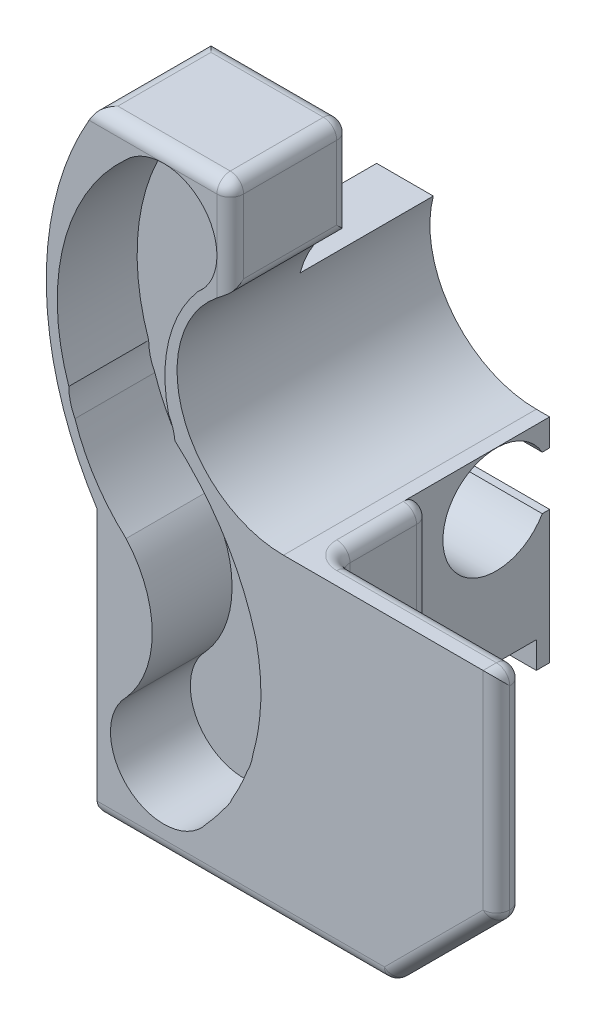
ISO-10303-21;
HEADER;
FILE_DESCRIPTION(('STEP AP214'),'2;1');
FILE_NAME('part.step','',(''),(''),'','','');
FILE_SCHEMA(('AUTOMOTIVE_DESIGN { 1 0 10303 214 1 1 1 1 }'));
ENDSEC;
DATA;
#1=APPLICATION_CONTEXT('core data for automotive mechanical design processes');
#2=APPLICATION_PROTOCOL_DEFINITION('international standard','automotive_design',2000,#1);
#3=PRODUCT_CONTEXT('',#1,'mechanical');
#4=PRODUCT('Part','Part','',(#3));
#5=PRODUCT_RELATED_PRODUCT_CATEGORY('part','',(#4));
#6=PRODUCT_DEFINITION_FORMATION('','',#4);
#7=PRODUCT_DEFINITION_CONTEXT('part definition',#1,'design');
#8=PRODUCT_DEFINITION('design','',#6,#7);
#9=PRODUCT_DEFINITION_SHAPE('','',#8);
#10=(LENGTH_UNIT() NAMED_UNIT(*) SI_UNIT(.MILLI.,.METRE.));
#11=(NAMED_UNIT(*) PLANE_ANGLE_UNIT() SI_UNIT($,.RADIAN.));
#12=(NAMED_UNIT(*) SI_UNIT($,.STERADIAN.) SOLID_ANGLE_UNIT());
#13=UNCERTAINTY_MEASURE_WITH_UNIT(LENGTH_MEASURE(1.E-05),#10,'distance_accuracy_value','');
#14=(GEOMETRIC_REPRESENTATION_CONTEXT(3) GLOBAL_UNCERTAINTY_ASSIGNED_CONTEXT((#13)) GLOBAL_UNIT_ASSIGNED_CONTEXT((#10,
#11,#12)) REPRESENTATION_CONTEXT('',''));
#15=CARTESIAN_POINT('',(0.,0.,0.));
#16=DIRECTION('',(0.,0.,1.));
#17=DIRECTION('',(1.,0.,0.));
#18=AXIS2_PLACEMENT_3D('',#15,#16,#17);
#19=CARTESIAN_POINT('',(29.087120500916,-33.4999999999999,9.5));
#20=DIRECTION('',(0.,0.,-1.));
#21=DIRECTION('',(-1.,0.,0.));
#22=AXIS2_PLACEMENT_3D('',#19,#20,#21);
#23=PLANE('',#22);
#24=CARTESIAN_POINT('',(26.001,-34.,9.5));
#25=DIRECTION('',(0.,0.,-1.));
#26=DIRECTION('',(-1.,0.,0.));
#27=AXIS2_PLACEMENT_3D('',#24,#25,#26);
#28=CIRCLE('',#27,4.000000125);
#29=CARTESIAN_POINT('',(26.,-38.,9.5));
#30=VERTEX_POINT('',#29);
#31=CARTESIAN_POINT('',(23.5,-30.8783017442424,9.5));
#32=VERTEX_POINT('',#31);
#33=EDGE_CURVE('E558',#30,#32,#28,.T.);
#34=ORIENTED_EDGE('',*,*,#33,.T.);
#35=DIRECTION('',(0.,1.,0.));
#36=VECTOR('',#35,1.);
#37=CARTESIAN_POINT('',(23.5,-33.4999999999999,9.5));
#38=LINE('',#37,#36);
#39=CARTESIAN_POINT('',(23.5,-29.5,9.5));
#40=VERTEX_POINT('',#39);
#41=EDGE_CURVE('E39',#32,#40,#38,.T.);
#42=ORIENTED_EDGE('',*,*,#41,.T.);
#43=CARTESIAN_POINT('',(21.5,-29.5,9.5));
#44=DIRECTION('',(0.,0.,1.));
#45=DIRECTION('',(1.,0.,0.));
#46=AXIS2_PLACEMENT_3D('',#43,#44,#45);
#47=CIRCLE('',#46,2.);
#48=CARTESIAN_POINT('',(22.7807345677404,-31.0361376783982,9.5));
#49=VERTEX_POINT('',#48);
#50=EDGE_CURVE('E428',#49,#40,#47,.T.);
#51=ORIENTED_EDGE('',*,*,#50,.F.);
#52=CARTESIAN_POINT('',(26.6946481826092,-34.3834768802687,9.5));
#53=DIRECTION('',(0.,0.,-1.));
#54=DIRECTION('',(1.,0.,0.));
#55=AXIS2_PLACEMENT_3D('',#52,#53,#54);
#56=CIRCLE('',#55,5.15008733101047);
#57=CARTESIAN_POINT('',(21.6824870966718,-35.5673859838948,9.5));
#58=VERTEX_POINT('',#57);
#59=EDGE_CURVE('E385',#58,#49,#56,.T.);
#60=ORIENTED_EDGE('',*,*,#59,.F.);
#61=CARTESIAN_POINT('',(19.9347856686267,-36.5397746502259,9.5));
#62=DIRECTION('',(0.,0.,1.));
#63=DIRECTION('',(1.,0.,0.));
#64=AXIS2_PLACEMENT_3D('',#61,#62,#63);
#65=CIRCLE('',#64,2.);
#66=CARTESIAN_POINT('',(21.9227339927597,-36.32054540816,9.5));
#67=VERTEX_POINT('',#66);
#68=EDGE_CURVE('E393',#67,#58,#65,.T.);
#69=ORIENTED_EDGE('',*,*,#68,.F.);
#70=CARTESIAN_POINT('',(15.30821313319,-43.8024903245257,9.5));
#71=DIRECTION('',(0.,0.,1.));
#72=DIRECTION('',(-1.,0.,0.));
#73=AXIS2_PLACEMENT_3D('',#70,#71,#72);
#74=CIRCLE('',#73,9.98656026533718);
#75=CARTESIAN_POINT('',(24.9383968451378,-41.1584503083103,9.5));
#76=VERTEX_POINT('',#75);
#77=EDGE_CURVE('E375',#76,#67,#74,.T.);
#78=ORIENTED_EDGE('',*,*,#77,.F.);
#79=CARTESIAN_POINT('',(23.0291193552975,-41.7539832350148,9.5));
#80=DIRECTION('',(0.,0.,1.));
#81=DIRECTION('',(1.,0.,0.));
#82=AXIS2_PLACEMENT_3D('',#79,#80,#81);
#83=CIRCLE('',#82,2.);
#84=CARTESIAN_POINT('',(24.9927459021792,-41.374284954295,9.5));
#85=VERTEX_POINT('',#84);
#86=EDGE_CURVE('E904',#85,#76,#83,.T.);
#87=ORIENTED_EDGE('',*,*,#86,.F.);
#88=CARTESIAN_POINT('',(17.3480538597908,-42.9273291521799,9.5));
#89=DIRECTION('',(0.,0.,1.));
#90=DIRECTION('',(1.,0.,0.));
#91=AXIS2_PLACEMENT_3D('',#88,#89,#90);
#92=CIRCLE('',#91,7.80085012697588);
#93=CARTESIAN_POINT('',(25.1480612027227,-42.8126637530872,9.5));
#94=VERTEX_POINT('',#93);
#95=EDGE_CURVE('E842',#94,#85,#92,.T.);
#96=ORIENTED_EDGE('',*,*,#95,.F.);
#97=CARTESIAN_POINT('',(23.1568542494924,-43.,9.5));
#98=DIRECTION('',(0.,0.,1.));
#99=DIRECTION('',(1.,0.,0.));
#100=AXIS2_PLACEMENT_3D('',#97,#98,#99);
#101=CIRCLE('',#100,2.);
#102=CARTESIAN_POINT('',(25.1427514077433,-43.2370917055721,9.5));
#103=VERTEX_POINT('',#102);
#104=EDGE_CURVE('E411',#103,#94,#101,.T.);
#105=ORIENTED_EDGE('',*,*,#104,.F.);
#106=CARTESIAN_POINT('',(24.8501886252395,-45.0653742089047,9.5));
#107=VERTEX_POINT('',#106);
#108=EDGE_CURVE('E922',#107,#103,#92,.T.);
#109=ORIENTED_EDGE('',*,*,#108,.F.);
#110=CARTESIAN_POINT('',(22.8715557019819,-44.7738064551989,9.5));
#111=DIRECTION('',(0.,0.,1.));
#112=DIRECTION('',(1.,0.,0.));
#113=AXIS2_PLACEMENT_3D('',#110,#111,#112);
#114=CIRCLE('',#113,2.);
#115=CARTESIAN_POINT('',(24.6277498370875,-45.7307715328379,9.5));
#116=VERTEX_POINT('',#115);
#117=EDGE_CURVE('E405',#116,#107,#114,.T.);
#118=ORIENTED_EDGE('',*,*,#117,.F.);
#119=CARTESIAN_POINT('',(24.0996407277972,-46.8349291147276,9.5));
#120=VERTEX_POINT('',#119);
#121=EDGE_CURVE('E843',#120,#116,#92,.T.);
#122=ORIENTED_EDGE('',*,*,#121,.F.);
#123=CARTESIAN_POINT('',(22.251259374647,-46.0710663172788,9.5));
#124=DIRECTION('',(0.,0.,1.));
#125=DIRECTION('',(1.,0.,0.));
#126=AXIS2_PLACEMENT_3D('',#123,#124,#125);
#127=CIRCLE('',#126,2.);
#128=CARTESIAN_POINT('',(23.7168361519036,-47.4319795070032,9.5));
#129=VERTEX_POINT('',#128);
#130=EDGE_CURVE('E908',#129,#120,#127,.T.);
#131=ORIENTED_EDGE('',*,*,#130,.F.);
#132=CARTESIAN_POINT('',(23.112223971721,-48.1835260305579,9.5));
#133=VERTEX_POINT('',#132);
#134=EDGE_CURVE('E386',#133,#129,#92,.T.);
#135=ORIENTED_EDGE('',*,*,#134,.F.);
#136=CARTESIAN_POINT('',(21.5,-47.,9.5));
#137=DIRECTION('',(0.,0.,1.));
#138=DIRECTION('',(1.,0.,0.));
#139=AXIS2_PLACEMENT_3D('',#136,#137,#138);
#140=CIRCLE('',#139,2.);
#141=CARTESIAN_POINT('',(20.0860944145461,-45.5854785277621,9.5));
#142=VERTEX_POINT('',#141);
#143=EDGE_CURVE('E414',#142,#133,#140,.T.);
#144=ORIENTED_EDGE('',*,*,#143,.F.);
#145=CARTESIAN_POINT('',(17.1763015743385,-43.,9.5));
#146=DIRECTION('',(0.,0.,-1.));
#147=DIRECTION('',(1.,0.,0.));
#148=AXIS2_PLACEMENT_3D('',#145,#146,#147);
#149=CIRCLE('',#148,3.89250479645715);
#150=CARTESIAN_POINT('',(20.086094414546,-40.4145214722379,9.5));
#151=VERTEX_POINT('',#150);
#152=EDGE_CURVE('E850',#151,#142,#149,.T.);
#153=ORIENTED_EDGE('',*,*,#152,.F.);
#154=CARTESIAN_POINT('',(24.5697822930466,-35.3905304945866,9.5));
#155=DIRECTION('',(0.,0.,1.));
#156=DIRECTION('',(-1.,0.,0.));
#157=AXIS2_PLACEMENT_3D('',#154,#155,#156);
#158=CIRCLE('',#157,6.73379108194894);
#159=CARTESIAN_POINT('',(18.1664581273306,-37.4741288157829,9.5));
#160=VERTEX_POINT('',#159);
#161=EDGE_CURVE('E848',#160,#151,#158,.T.);
#162=ORIENTED_EDGE('',*,*,#161,.F.);
#163=CARTESIAN_POINT('',(17.9347856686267,-36.5397746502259,9.5));
#164=VERTEX_POINT('',#163);
#165=EDGE_CURVE('E400',#164,#160,#65,.T.);
#166=ORIENTED_EDGE('',*,*,#165,.F.);
#167=CARTESIAN_POINT('',(25.4416922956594,-33.9491447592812,9.5));
#168=DIRECTION('',(0.,0.,1.));
#169=DIRECTION('',(-1.,0.,0.));
#170=AXIS2_PLACEMENT_3D('',#167,#168,#169);
#171=CIRCLE('',#170,7.94134814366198);
#172=CARTESIAN_POINT('',(20.086094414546,-28.0854785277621,9.5));
#173=VERTEX_POINT('',#172);
#174=EDGE_CURVE('E846',#173,#164,#171,.T.);
#175=ORIENTED_EDGE('',*,*,#174,.F.);
#176=CARTESIAN_POINT('',(21.5,-27.5,9.5));
#177=VERTEX_POINT('',#176);
#178=EDGE_CURVE('E424',#177,#173,#47,.T.);
#179=ORIENTED_EDGE('',*,*,#178,.F.);
#180=DIRECTION('',(-1.,0.,0.));
#181=VECTOR('',#180,1.);
#182=CARTESIAN_POINT('',(29.087120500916,-27.5,9.5));
#183=LINE('',#182,#181);
#184=CARTESIAN_POINT('',(18.6948156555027,-27.5,9.5));
#185=VERTEX_POINT('',#184);
#186=EDGE_CURVE('E632',#177,#185,#183,.T.);
#187=ORIENTED_EDGE('',*,*,#186,.T.);
#188=CARTESIAN_POINT('',(29.087120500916,-33.4999999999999,9.5));
#189=DIRECTION('',(0.,0.,1.));
#190=DIRECTION('',(-1.,0.,0.));
#191=AXIS2_PLACEMENT_3D('',#188,#189,#190);
#192=CIRCLE('',#191,12.);
#193=CARTESIAN_POINT('',(19.,-40.,9.5));
#194=VERTEX_POINT('',#193);
#195=EDGE_CURVE('E551',#185,#194,#192,.T.);
#196=ORIENTED_EDGE('',*,*,#195,.T.);
#197=DIRECTION('',(0.,-1.,0.));
#198=VECTOR('',#197,1.);
#199=CARTESIAN_POINT('',(19.,-40.,9.5));
#200=LINE('',#199,#198);
#201=CARTESIAN_POINT('',(19.,-49.5,9.5));
#202=VERTEX_POINT('',#201);
#203=EDGE_CURVE('E553',#194,#202,#200,.T.);
#204=ORIENTED_EDGE('',*,*,#203,.T.);
#205=DIRECTION('',(1.,0.,0.));
#206=VECTOR('',#205,1.);
#207=CARTESIAN_POINT('',(29.087120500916,-49.5,9.5));
#208=LINE('',#207,#206);
#209=CARTESIAN_POINT('',(29.7928932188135,-49.5,9.5));
#210=VERTEX_POINT('',#209);
#211=EDGE_CURVE('E692',#202,#210,#208,.T.);
#212=ORIENTED_EDGE('',*,*,#211,.T.);
#213=DIRECTION('',(0.707106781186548,0.707106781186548,0.));
#214=VECTOR('',#213,1.);
#215=CARTESIAN_POINT('',(37.4400068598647,-41.8528863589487,9.5));
#216=LINE('',#215,#214);
#217=CARTESIAN_POINT('',(33.5,-45.7928932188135,9.5));
#218=VERTEX_POINT('',#217);
#219=EDGE_CURVE('E708',#210,#218,#216,.T.);
#220=ORIENTED_EDGE('',*,*,#219,.T.);
#221=DIRECTION('',(0.,1.,0.));
#222=VECTOR('',#221,1.);
#223=CARTESIAN_POINT('',(33.5,-33.4999999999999,9.5));
#224=LINE('',#223,#222);
#225=CARTESIAN_POINT('',(33.5,-38.,9.5));
#226=VERTEX_POINT('',#225);
#227=EDGE_CURVE('E718',#218,#226,#224,.T.);
#228=ORIENTED_EDGE('',*,*,#227,.T.);
#229=DIRECTION('',(-1.,0.,0.));
#230=VECTOR('',#229,1.);
#231=CARTESIAN_POINT('',(34.,-38.,9.5));
#232=LINE('',#231,#230);
#233=EDGE_CURVE('E556',#226,#30,#232,.T.);
#234=ORIENTED_EDGE('',*,*,#233,.T.);
#235=EDGE_LOOP('',(#34,#42,#51,#60,#69,#78,#87,#96,#105,#109,#118,#122,#131,#135,#144,#153,#162,
#166,#175,#179,#187,#196,#204,#212,#220,#228,#234));
#236=FACE_BOUND('',#235,.T.);
#237=ADVANCED_FACE('F30',(#236),#23,.F.);
#238=CARTESIAN_POINT('',(23.1568542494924,-43.,6.5));
#239=DIRECTION('',(0.,0.,1.));
#240=DIRECTION('',(1.,0.,0.));
#241=AXIS2_PLACEMENT_3D('',#238,#239,#240);
#242=CYLINDRICAL_SURFACE('',#241,2.);
#243=CARTESIAN_POINT('',(23.1568542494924,-43.,6.5));
#244=DIRECTION('',(0.,0.,1.));
#245=DIRECTION('',(1.,0.,0.));
#246=AXIS2_PLACEMENT_3D('',#243,#244,#245);
#247=CIRCLE('',#246,2.);
#248=CARTESIAN_POINT('',(25.1427514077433,-43.2370917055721,6.5));
#249=VERTEX_POINT('',#248);
#250=CARTESIAN_POINT('',(25.1480612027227,-42.8126637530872,6.5));
#251=VERTEX_POINT('',#250);
#252=EDGE_CURVE('E415',#249,#251,#247,.T.);
#253=ORIENTED_EDGE('',*,*,#252,.F.);
#254=DIRECTION('',(0.,0.,1.));
#255=VECTOR('',#254,1.);
#256=CARTESIAN_POINT('',(25.1427514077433,-43.2370917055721,8.));
#257=LINE('',#256,#255);
#258=EDGE_CURVE('E901',#249,#103,#257,.T.);
#259=ORIENTED_EDGE('',*,*,#258,.T.);
#260=ORIENTED_EDGE('',*,*,#104,.T.);
#261=DIRECTION('',(0.,0.,1.));
#262=VECTOR('',#261,1.);
#263=CARTESIAN_POINT('',(25.1480612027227,-42.8126637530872,8.));
#264=LINE('',#263,#262);
#265=EDGE_CURVE('E898',#94,#251,#264,.F.);
#266=ORIENTED_EDGE('',*,*,#265,.T.);
#267=EDGE_LOOP('',(#253,#259,#260,#266));
#268=FACE_BOUND('',#267,.T.);
#269=ADVANCED_FACE('F785',(#268),#242,.F.);
#270=CARTESIAN_POINT('',(29.087120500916,-33.4999999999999,0.));
#271=DIRECTION('',(0.,0.,-1.));
#272=DIRECTION('',(-1.,0.,0.));
#273=AXIS2_PLACEMENT_3D('',#270,#271,#272);
#274=PLANE('',#273);
#275=DIRECTION('',(-1.,0.,0.));
#276=VECTOR('',#275,1.);
#277=CARTESIAN_POINT('',(20.,-41.01,0.));
#278=LINE('',#277,#276);
#279=CARTESIAN_POINT('',(26.5,-41.01,0.));
#280=VERTEX_POINT('',#279);
#281=CARTESIAN_POINT('',(20.,-41.01,0.));
#282=VERTEX_POINT('',#281);
#283=EDGE_CURVE('E473',#280,#282,#278,.T.);
#284=ORIENTED_EDGE('',*,*,#283,.F.);
#285=DIRECTION('',(0.,1.,0.));
#286=VECTOR('',#285,1.);
#287=CARTESIAN_POINT('',(26.5,-46.,0.));
#288=LINE('',#287,#286);
#289=CARTESIAN_POINT('',(26.5,-46.,0.));
#290=VERTEX_POINT('',#289);
#291=EDGE_CURVE('E514',#290,#280,#288,.T.);
#292=ORIENTED_EDGE('',*,*,#291,.F.);
#293=DIRECTION('',(1.,0.,0.));
#294=VECTOR('',#293,1.);
#295=CARTESIAN_POINT('',(20.,-46.,0.));
#296=LINE('',#295,#294);
#297=CARTESIAN_POINT('',(20.,-46.,0.));
#298=VERTEX_POINT('',#297);
#299=EDGE_CURVE('E510',#298,#290,#296,.T.);
#300=ORIENTED_EDGE('',*,*,#299,.F.);
#301=DIRECTION('',(0.,-1.,0.));
#302=VECTOR('',#301,1.);
#303=CARTESIAN_POINT('',(20.,-33.,0.));
#304=LINE('',#303,#302);
#305=EDGE_CURVE('E506',#282,#298,#304,.T.);
#306=ORIENTED_EDGE('',*,*,#305,.F.);
#307=EDGE_LOOP('',(#284,#292,#300,#306));
#308=FACE_BOUND('',#307,.T.);
#309=ADVANCED_FACE('F790',(#308),#274,.T.);
#310=CARTESIAN_POINT('',(29.087120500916,-33.4999999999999,9.5));
#311=DIRECTION('',(0.,0.,-1.));
#312=DIRECTION('',(-1.,0.,0.));
#313=AXIS2_PLACEMENT_3D('',#310,#311,#312);
#314=CYLINDRICAL_SURFACE('',#313,12.);
#315=ORIENTED_EDGE('',*,*,#195,.F.);
#316=CARTESIAN_POINT('',(18.6948156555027,-27.5,9.5));
#317=CARTESIAN_POINT('',(18.7163797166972,-27.4626239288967,9.50002015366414));
#318=CARTESIAN_POINT('',(18.7382192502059,-27.4252882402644,9.49580871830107));
#319=CARTESIAN_POINT('',(18.7809494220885,-27.3530919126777,9.47932492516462));
#320=CARTESIAN_POINT('',(18.8018503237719,-27.3181939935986,9.4672413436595));
#321=CARTESIAN_POINT('',(18.8267699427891,-27.2770350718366,9.44761682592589));
#322=CARTESIAN_POINT('',(18.8314319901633,-27.2693552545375,9.44370910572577));
#323=CARTESIAN_POINT('',(18.8406984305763,-27.2541283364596,9.43545647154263));
#324=CARTESIAN_POINT('',(18.8453023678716,-27.2465821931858,9.43110927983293));
#325=CARTESIAN_POINT('',(18.8498595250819,-27.2391304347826,9.42655254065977));
#326=B_SPLINE_CURVE_WITH_KNOTS('',3,(#316,#317,#318,#319,#320,#321,#322,#323,#324,#325),
.UNSPECIFIED.,.F.,.F.,(4,2,2,2,4),(0.,0.129449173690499,0.255903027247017,0.285287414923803,
0.314832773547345),.UNSPECIFIED.);
#327=CARTESIAN_POINT('',(18.8498595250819,-27.2391304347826,9.42655254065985));
#328=VERTEX_POINT('',#327);
#329=EDGE_CURVE('E660',#185,#328,#326,.T.);
#330=ORIENTED_EDGE('',*,*,#329,.T.);
#331=DIRECTION('',(0.,0.,-1.));
#332=VECTOR('',#331,1.);
#333=CARTESIAN_POINT('',(18.8498595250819,-27.2391304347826,9.5));
#334=LINE('',#333,#332);
#335=CARTESIAN_POINT('',(18.8498595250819,-27.2391304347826,5.07344745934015));
#336=VERTEX_POINT('',#335);
#337=EDGE_CURVE('E643',#328,#336,#334,.T.);
#338=ORIENTED_EDGE('',*,*,#337,.T.);
#339=CARTESIAN_POINT('',(18.8498595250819,-27.2391304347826,5.07344745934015));
#340=CARTESIAN_POINT('',(18.8298220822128,-27.2718675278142,5.05342449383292));
#341=CARTESIAN_POINT('',(18.8088924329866,-27.3064663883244,5.03743813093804));
#342=CARTESIAN_POINT('',(18.76667260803,-27.3770993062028,5.01394702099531));
#343=CARTESIAN_POINT('',(18.7454011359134,-27.4130835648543,5.00625955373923));
#344=CARTESIAN_POINT('',(18.7143615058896,-27.4662385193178,5.00085483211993));
#345=CARTESIAN_POINT('',(18.7045627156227,-27.4831132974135,4.99999850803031));
#346=CARTESIAN_POINT('',(18.6948156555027,-27.5,5.));
#347=B_SPLINE_CURVE_WITH_KNOTS('',3,(#339,#340,#341,#342,#343,#344,#345,#346),.UNSPECIFIED.,.F.,
.F.,(4,2,2,4),(0.,0.129602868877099,0.256290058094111,0.314805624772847),.UNSPECIFIED.);
#348=CARTESIAN_POINT('',(18.6948156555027,-27.5,5.));
#349=VERTEX_POINT('',#348);
#350=EDGE_CURVE('E636',#336,#349,#347,.T.);
#351=ORIENTED_EDGE('',*,*,#350,.T.);
#352=CARTESIAN_POINT('',(29.087120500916,-33.4999999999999,5.));
#353=DIRECTION('',(0.,0.,-1.));
#354=DIRECTION('',(-1.,0.,0.));
#355=AXIS2_PLACEMENT_3D('',#352,#353,#354);
#356=CIRCLE('',#355,12.);
#357=CARTESIAN_POINT('',(19.,-40.,5.));
#358=VERTEX_POINT('',#357);
#359=EDGE_CURVE('E541',#358,#349,#356,.T.);
#360=ORIENTED_EDGE('',*,*,#359,.F.);
#361=DIRECTION('',(0.,0.,-1.));
#362=VECTOR('',#361,1.);
#363=CARTESIAN_POINT('',(19.,-40.,9.5));
#364=LINE('',#363,#362);
#365=EDGE_CURVE('E563',#194,#358,#364,.T.);
#366=ORIENTED_EDGE('',*,*,#365,.F.);
#367=EDGE_LOOP('',(#315,#330,#338,#351,#360,#366));
#368=FACE_BOUND('',#367,.T.);
#369=ADVANCED_FACE('F32',(#368),#314,.T.);
#370=CARTESIAN_POINT('',(19.,-40.,9.5));
#371=DIRECTION('',(1.,0.,0.));
#372=DIRECTION('',(0.,1.,0.));
#373=AXIS2_PLACEMENT_3D('',#370,#371,#372);
#374=PLANE('',#373);
#375=DIRECTION('',(0.,1.,0.));
#376=VECTOR('',#375,1.);
#377=CARTESIAN_POINT('',(19.,-40.,5.));
#378=LINE('',#377,#376);
#379=CARTESIAN_POINT('',(19.,-49.5,5.));
#380=VERTEX_POINT('',#379);
#381=EDGE_CURVE('E544',#380,#358,#378,.T.);
#382=ORIENTED_EDGE('',*,*,#381,.F.);
#383=DIRECTION('',(0.,0.,-1.));
#384=VECTOR('',#383,1.);
#385=CARTESIAN_POINT('',(19.,-49.5,9.5));
#386=LINE('',#385,#384);
#387=EDGE_CURVE('E690',#380,#202,#386,.F.);
#388=ORIENTED_EDGE('',*,*,#387,.T.);
#389=ORIENTED_EDGE('',*,*,#203,.F.);
#390=ORIENTED_EDGE('',*,*,#365,.T.);
#391=EDGE_LOOP('',(#382,#388,#389,#390));
#392=FACE_BOUND('',#391,.T.);
#393=ADVANCED_FACE('F989',(#392),#374,.F.);
#394=CARTESIAN_POINT('',(19.,-50.,9.5));
#395=DIRECTION('',(0.,1.,0.));
#396=DIRECTION('',(0.,0.,1.));
#397=AXIS2_PLACEMENT_3D('',#394,#395,#396);
#398=PLANE('',#397);
#399=CARTESIAN_POINT('',(27.5,-50.,8.));
#400=DIRECTION('',(0.,1.,0.));
#401=DIRECTION('',(0.,0.,1.));
#402=AXIS2_PLACEMENT_3D('',#399,#400,#401);
#403=CIRCLE('',#402,1.);
#404=CARTESIAN_POINT('',(27.5,-50.,9.));
#405=VERTEX_POINT('',#404);
#406=CARTESIAN_POINT('',(26.5,-50.,8.));
#407=VERTEX_POINT('',#406);
#408=EDGE_CURVE('E586',#405,#407,#403,.F.);
#409=ORIENTED_EDGE('',*,*,#408,.F.);
#410=DIRECTION('',(1.,0.,0.));
#411=VECTOR('',#410,1.);
#412=CARTESIAN_POINT('',(19.,-50.,9.));
#413=LINE('',#412,#411);
#414=CARTESIAN_POINT('',(19.5,-50.,9.));
#415=VERTEX_POINT('',#414);
#416=EDGE_CURVE('E688',#405,#415,#413,.F.);
#417=ORIENTED_EDGE('',*,*,#416,.T.);
#418=DIRECTION('',(0.,0.,-1.));
#419=VECTOR('',#418,1.);
#420=CARTESIAN_POINT('',(19.5,-50.,9.5));
#421=LINE('',#420,#419);
#422=CARTESIAN_POINT('',(19.5,-50.,5.5));
#423=VERTEX_POINT('',#422);
#424=EDGE_CURVE('E686',#415,#423,#421,.T.);
#425=ORIENTED_EDGE('',*,*,#424,.T.);
#426=DIRECTION('',(-1.,0.,0.));
#427=VECTOR('',#426,1.);
#428=CARTESIAN_POINT('',(26.5,-50.,5.5));
#429=LINE('',#428,#427);
#430=CARTESIAN_POINT('',(26.5,-50.,5.5));
#431=VERTEX_POINT('',#430);
#432=EDGE_CURVE('E684',#423,#431,#429,.F.);
#433=ORIENTED_EDGE('',*,*,#432,.T.);
#434=DIRECTION('',(0.,0.,-1.));
#435=VECTOR('',#434,1.);
#436=CARTESIAN_POINT('',(26.5,-50.,9.5));
#437=LINE('',#436,#435);
#438=EDGE_CURVE('E589',#431,#407,#437,.F.);
#439=ORIENTED_EDGE('',*,*,#438,.T.);
#440=EDGE_LOOP('',(#409,#417,#425,#433,#439));
#441=FACE_BOUND('',#440,.T.);
#442=ADVANCED_FACE('F1003',(#441),#398,.F.);
#443=CARTESIAN_POINT('',(24.,-30.536475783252,9.5));
#444=DIRECTION('',(-1.,0.,0.));
#445=DIRECTION('',(0.,-1.,0.));
#446=AXIS2_PLACEMENT_3D('',#443,#444,#445);
#447=PLANE('',#446);
#448=DIRECTION('',(0.,0.,-1.));
#449=VECTOR('',#448,1.);
#450=CARTESIAN_POINT('',(24.,-27.5,9.5));
#451=LINE('',#450,#449);
#452=CARTESIAN_POINT('',(24.,-27.5,5.5));
#453=VERTEX_POINT('',#452);
#454=CARTESIAN_POINT('',(24.,-27.5,9.));
#455=VERTEX_POINT('',#454);
#456=EDGE_CURVE('E629',#453,#455,#451,.F.);
#457=ORIENTED_EDGE('',*,*,#456,.T.);
#458=DIRECTION('',(0.,1.,0.));
#459=VECTOR('',#458,1.);
#460=CARTESIAN_POINT('',(24.,-30.536475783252,9.));
#461=LINE('',#460,#459);
#462=CARTESIAN_POINT('',(24.,-30.2590108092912,9.));
#463=VERTEX_POINT('',#462);
#464=EDGE_CURVE('E735',#455,#463,#461,.F.);
#465=ORIENTED_EDGE('',*,*,#464,.T.);
#466=DIRECTION('',(0.,0.,-1.));
#467=VECTOR('',#466,1.);
#468=CARTESIAN_POINT('',(24.,-30.2590108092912,9.5));
#469=LINE('',#468,#467);
#470=CARTESIAN_POINT('',(24.,-30.2590108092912,5.5));
#471=VERTEX_POINT('',#470);
#472=EDGE_CURVE('E733',#463,#471,#469,.T.);
#473=ORIENTED_EDGE('',*,*,#472,.T.);
#474=DIRECTION('',(0.,-1.,0.));
#475=VECTOR('',#474,1.);
#476=CARTESIAN_POINT('',(24.,-25.7076071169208,5.5));
#477=LINE('',#476,#475);
#478=EDGE_CURVE('E731',#471,#453,#477,.F.);
#479=ORIENTED_EDGE('',*,*,#478,.T.);
#480=EDGE_LOOP('',(#457,#465,#473,#479));
#481=FACE_BOUND('',#480,.T.);
#482=ADVANCED_FACE('F757',(#481),#447,.F.);
#483=CARTESIAN_POINT('',(24.,-27.,9.5));
#484=DIRECTION('',(0.,-1.,0.));
#485=DIRECTION('',(1.,0.,0.));
#486=AXIS2_PLACEMENT_3D('',#483,#484,#485);
#487=PLANE('',#486);
#488=DIRECTION('',(-1.,0.,0.));
#489=VECTOR('',#488,1.);
#490=CARTESIAN_POINT('',(24.,-27.,9.));
#491=LINE('',#490,#489);
#492=CARTESIAN_POINT('',(19.2764120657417,-27.,9.));
#493=VERTEX_POINT('',#492);
#494=CARTESIAN_POINT('',(23.5,-27.,9.));
#495=VERTEX_POINT('',#494);
#496=EDGE_CURVE('E623',#493,#495,#491,.F.);
#497=ORIENTED_EDGE('',*,*,#496,.T.);
#498=DIRECTION('',(0.,0.,-1.));
#499=VECTOR('',#498,1.);
#500=CARTESIAN_POINT('',(23.5,-27.,9.5));
#501=LINE('',#500,#499);
#502=CARTESIAN_POINT('',(23.5,-27.,5.5));
#503=VERTEX_POINT('',#502);
#504=EDGE_CURVE('E626',#495,#503,#501,.T.);
#505=ORIENTED_EDGE('',*,*,#504,.T.);
#506=DIRECTION('',(1.,0.,0.));
#507=VECTOR('',#506,1.);
#508=CARTESIAN_POINT('',(26.5,-27.,5.5));
#509=LINE('',#508,#507);
#510=CARTESIAN_POINT('',(19.2764120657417,-27.,5.5));
#511=VERTEX_POINT('',#510);
#512=EDGE_CURVE('E619',#503,#511,#509,.F.);
#513=ORIENTED_EDGE('',*,*,#512,.T.);
#514=DIRECTION('',(0.,0.,-1.));
#515=VECTOR('',#514,1.);
#516=CARTESIAN_POINT('',(19.2764120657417,-27.,9.5));
#517=LINE('',#516,#515);
#518=EDGE_CURVE('E621',#511,#493,#517,.F.);
#519=ORIENTED_EDGE('',*,*,#518,.T.);
#520=EDGE_LOOP('',(#497,#505,#513,#519));
#521=FACE_BOUND('',#520,.T.);
#522=ADVANCED_FACE('F1093',(#521),#487,.F.);
#523=CARTESIAN_POINT('',(34.,-38.,9.5));
#524=DIRECTION('',(0.,-1.,0.));
#525=DIRECTION('',(0.,0.,-1.));
#526=AXIS2_PLACEMENT_3D('',#523,#524,#525);
#527=PLANE('',#526);
#528=ORIENTED_EDGE('',*,*,#233,.F.);
#529=DIRECTION('',(0.,0.,-1.));
#530=VECTOR('',#529,1.);
#531=CARTESIAN_POINT('',(33.5,-38.,9.5));
#532=LINE('',#531,#530);
#533=CARTESIAN_POINT('',(33.5,-38.,9.));
#534=VERTEX_POINT('',#533);
#535=EDGE_CURVE('E720',#226,#534,#532,.T.);
#536=ORIENTED_EDGE('',*,*,#535,.T.);
#537=DIRECTION('',(1.,0.,0.));
#538=VECTOR('',#537,1.);
#539=CARTESIAN_POINT('',(34.,-38.,9.));
#540=LINE('',#539,#538);
#541=CARTESIAN_POINT('',(27.5,-38.,9.));
#542=VERTEX_POINT('',#541);
#543=EDGE_CURVE('E594',#534,#542,#540,.F.);
#544=ORIENTED_EDGE('',*,*,#543,.T.);
#545=CARTESIAN_POINT('',(27.5,-38.,8.));
#546=DIRECTION('',(0.,-1.,0.));
#547=DIRECTION('',(0.,0.,-1.));
#548=AXIS2_PLACEMENT_3D('',#545,#546,#547);
#549=CIRCLE('',#548,1.);
#550=CARTESIAN_POINT('',(26.5,-38.,8.));
#551=VERTEX_POINT('',#550);
#552=EDGE_CURVE('E591',#551,#542,#549,.F.);
#553=ORIENTED_EDGE('',*,*,#552,.F.);
#554=DIRECTION('',(0.,0.,-1.));
#555=VECTOR('',#554,1.);
#556=CARTESIAN_POINT('',(26.5,-38.,9.5));
#557=LINE('',#556,#555);
#558=CARTESIAN_POINT('',(26.5,-38.,5.5));
#559=VERTEX_POINT('',#558);
#560=EDGE_CURVE('E596',#551,#559,#557,.T.);
#561=ORIENTED_EDGE('',*,*,#560,.T.);
#562=DIRECTION('',(0.,0.,-1.));
#563=VECTOR('',#562,1.);
#564=CARTESIAN_POINT('',(26.5,-38.,9.5));
#565=LINE('',#564,#563);
#566=CARTESIAN_POINT('',(26.5,-38.,0.));
#567=VERTEX_POINT('',#566);
#568=EDGE_CURVE('E536',#559,#567,#565,.T.);
#569=ORIENTED_EDGE('',*,*,#568,.T.);
#570=DIRECTION('',(-1.,0.,0.));
#571=VECTOR('',#570,1.);
#572=CARTESIAN_POINT('',(34.,-38.,0.));
#573=LINE('',#572,#571);
#574=CARTESIAN_POINT('',(26.,-38.,0.));
#575=VERTEX_POINT('',#574);
#576=EDGE_CURVE('E546',#567,#575,#573,.T.);
#577=ORIENTED_EDGE('',*,*,#576,.T.);
#578=DIRECTION('',(0.,0.,-1.));
#579=VECTOR('',#578,1.);
#580=CARTESIAN_POINT('',(26.,-38.,9.5));
#581=LINE('',#580,#579);
#582=EDGE_CURVE('E560',#30,#575,#581,.T.);
#583=ORIENTED_EDGE('',*,*,#582,.F.);
#584=EDGE_LOOP('',(#528,#536,#544,#553,#561,#569,#577,#583));
#585=FACE_BOUND('',#584,.T.);
#586=ADVANCED_FACE('F756',(#585),#527,.F.);
#587=CARTESIAN_POINT('',(26.001,-34.,9.5));
#588=DIRECTION('',(0.,0.,-1.));
#589=DIRECTION('',(-1.,0.,0.));
#590=AXIS2_PLACEMENT_3D('',#587,#588,#589);
#591=CYLINDRICAL_SURFACE('',#590,4.000000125);
#592=DIRECTION('',(0.,0.,-1.));
#593=VECTOR('',#592,1.);
#594=CARTESIAN_POINT('',(23.7778888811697,-30.6746762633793,9.5));
#595=LINE('',#594,#593);
#596=CARTESIAN_POINT('',(23.7778888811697,-30.6746762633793,5.08433454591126));
#597=VERTEX_POINT('',#596);
#598=CARTESIAN_POINT('',(23.7778888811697,-30.6746762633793,9.41566545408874));
#599=VERTEX_POINT('',#598);
#600=EDGE_CURVE('E53',#597,#599,#595,.F.);
#601=ORIENTED_EDGE('',*,*,#600,.T.);
#602=CARTESIAN_POINT('',(23.7778888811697,-30.6746762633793,9.41566545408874));
#603=CARTESIAN_POINT('',(23.7463814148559,-30.6956970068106,9.43671942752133));
#604=CARTESIAN_POINT('',(23.7134468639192,-30.7184026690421,9.45358284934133));
#605=CARTESIAN_POINT('',(23.6470159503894,-30.7657596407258,9.479191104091));
#606=CARTESIAN_POINT('',(23.6135477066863,-30.7903574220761,9.48810571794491));
#607=CARTESIAN_POINT('',(23.5668186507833,-30.8258775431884,9.49570104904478));
#608=CARTESIAN_POINT('',(23.5534675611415,-30.8361613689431,9.49731317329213));
#609=CARTESIAN_POINT('',(23.526723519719,-30.8570327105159,9.49946633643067));
#610=CARTESIAN_POINT('',(23.5133312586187,-30.8676221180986,9.49999768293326));
#611=CARTESIAN_POINT('',(23.5,-30.8783017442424,9.5));
#612=B_SPLINE_CURVE_WITH_KNOTS('',3,(#602,#603,#604,#605,#606,#607,#608,#609,#610,#611),
.UNSPECIFIED.,.F.,.F.,(4,2,2,2,4),(0.,0.129517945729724,0.256198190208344,0.306961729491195,
0.358178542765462),.UNSPECIFIED.);
#613=EDGE_CURVE('E761',#599,#32,#612,.T.);
#614=ORIENTED_EDGE('',*,*,#613,.T.);
#615=ORIENTED_EDGE('',*,*,#33,.F.);
#616=ORIENTED_EDGE('',*,*,#582,.T.);
#617=CARTESIAN_POINT('',(26.001,-34.,0.));
#618=DIRECTION('',(0.,0.,-1.));
#619=DIRECTION('',(-1.,0.,0.));
#620=AXIS2_PLACEMENT_3D('',#617,#618,#619);
#621=CIRCLE('',#620,4.000000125);
#622=CARTESIAN_POINT('',(22.1280165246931,-33.,0.));
#623=VERTEX_POINT('',#622);
#624=EDGE_CURVE('E548',#575,#623,#621,.T.);
#625=ORIENTED_EDGE('',*,*,#624,.T.);
#626=DIRECTION('',(0.,0.,-1.));
#627=VECTOR('',#626,1.);
#628=CARTESIAN_POINT('',(22.1280165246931,-33.,9.5));
#629=LINE('',#628,#627);
#630=CARTESIAN_POINT('',(22.1280165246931,-33.,5.));
#631=VERTEX_POINT('',#630);
#632=EDGE_CURVE('E528',#623,#631,#629,.F.);
#633=ORIENTED_EDGE('',*,*,#632,.T.);
#634=CARTESIAN_POINT('',(26.001,-34.,5.));
#635=DIRECTION('',(0.,0.,-1.));
#636=DIRECTION('',(-1.,0.,0.));
#637=AXIS2_PLACEMENT_3D('',#634,#635,#636);
#638=CIRCLE('',#637,4.000000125);
#639=CARTESIAN_POINT('',(23.5,-30.8783017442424,5.));
#640=VERTEX_POINT('',#639);
#641=EDGE_CURVE('E539',#640,#631,#638,.F.);
#642=ORIENTED_EDGE('',*,*,#641,.F.);
#643=CARTESIAN_POINT('',(23.5,-30.8783017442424,5.));
#644=CARTESIAN_POINT('',(23.5334346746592,-30.8514689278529,4.99998047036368));
#645=CARTESIAN_POINT('',(23.5674968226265,-30.825107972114,5.00336101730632));
#646=CARTESIAN_POINT('',(23.6346234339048,-30.7748011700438,5.01727785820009));
#647=CARTESIAN_POINT('',(23.6676924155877,-30.7508129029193,5.02764272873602));
#648=CARTESIAN_POINT('',(23.7132498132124,-30.7187699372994,5.04752492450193));
#649=CARTESIAN_POINT('',(23.7263750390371,-30.7096609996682,5.05393774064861));
#650=CARTESIAN_POINT('',(23.7523817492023,-30.691833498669,5.06811467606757));
#651=CARTESIAN_POINT('',(23.7652595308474,-30.6831196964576,5.07589155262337));
#652=CARTESIAN_POINT('',(23.7778888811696,-30.6746762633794,5.08433454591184));
#653=B_SPLINE_CURVE_WITH_KNOTS('',3,(#643,#644,#645,#646,#647,#648,#649,#650,#651,#652),
.UNSPECIFIED.,.F.,.F.,(4,2,2,2,4),(0.,0.128796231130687,0.254541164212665,0.306134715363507,
0.358239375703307),.UNSPECIFIED.);
#654=EDGE_CURVE('E737',#640,#597,#653,.T.);
#655=ORIENTED_EDGE('',*,*,#654,.T.);
#656=EDGE_LOOP('',(#601,#614,#615,#616,#625,#633,#642,#655));
#657=FACE_BOUND('',#656,.T.);
#658=ADVANCED_FACE('F750',(#657),#591,.F.);
#659=EDGE_CURVE('E423',#40,#177,#47,.T.);
#660=ORIENTED_EDGE('',*,*,#659,.F.);
#661=DIRECTION('',(0.,1.,0.));
#662=VECTOR('',#661,1.);
#663=CARTESIAN_POINT('',(23.5,-33.4999999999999,9.5));
#664=LINE('',#663,#662);
#665=CARTESIAN_POINT('',(23.5,-27.5,9.5));
#666=VERTEX_POINT('',#665);
#667=EDGE_CURVE('E768',#40,#666,#664,.T.);
#668=ORIENTED_EDGE('',*,*,#667,.T.);
#669=EDGE_CURVE('E633',#666,#177,#183,.T.);
#670=ORIENTED_EDGE('',*,*,#669,.T.);
#671=EDGE_LOOP('',(#660,#668,#670));
#672=FACE_BOUND('',#671,.T.);
#673=ADVANCED_FACE('F755',(#672),#23,.F.);
#674=DIRECTION('',(1.,0.,0.));
#675=VECTOR('',#674,1.);
#676=CARTESIAN_POINT('',(20.,-39.01,0.));
#677=LINE('',#676,#675);
#678=CARTESIAN_POINT('',(20.,-39.01,0.));
#679=VERTEX_POINT('',#678);
#680=CARTESIAN_POINT('',(26.5,-39.01,0.));
#681=VERTEX_POINT('',#680);
#682=EDGE_CURVE('E471',#679,#681,#677,.T.);
#683=ORIENTED_EDGE('',*,*,#682,.F.);
#684=CARTESIAN_POINT('',(20.,-33.,0.));
#685=VERTEX_POINT('',#684);
#686=EDGE_CURVE('E507',#685,#679,#304,.T.);
#687=ORIENTED_EDGE('',*,*,#686,.F.);
#688=DIRECTION('',(-1.,0.,0.));
#689=VECTOR('',#688,1.);
#690=CARTESIAN_POINT('',(26.001,-33.,0.));
#691=LINE('',#690,#689);
#692=EDGE_CURVE('E504',#623,#685,#691,.T.);
#693=ORIENTED_EDGE('',*,*,#692,.F.);
#694=ORIENTED_EDGE('',*,*,#624,.F.);
#695=ORIENTED_EDGE('',*,*,#576,.F.);
#696=EDGE_CURVE('E513',#681,#567,#288,.T.);
#697=ORIENTED_EDGE('',*,*,#696,.F.);
#698=EDGE_LOOP('',(#683,#687,#693,#694,#695,#697));
#699=FACE_BOUND('',#698,.T.);
#700=ADVANCED_FACE('F795',(#699),#274,.T.);
#701=CARTESIAN_POINT('',(26.5,-25.7076071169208,5.));
#702=DIRECTION('',(0.,0.,-1.));
#703=DIRECTION('',(-1.,0.,0.));
#704=AXIS2_PLACEMENT_3D('',#701,#702,#703);
#705=PLANE('',#704);
#706=DIRECTION('',(1.,0.,0.));
#707=VECTOR('',#706,1.);
#708=CARTESIAN_POINT('',(26.5,-27.5,5.));
#709=LINE('',#708,#707);
#710=CARTESIAN_POINT('',(23.5,-27.5,5.));
#711=VERTEX_POINT('',#710);
#712=EDGE_CURVE('E666',#349,#711,#709,.T.);
#713=ORIENTED_EDGE('',*,*,#712,.T.);
#714=DIRECTION('',(0.,-1.,0.));
#715=VECTOR('',#714,1.);
#716=CARTESIAN_POINT('',(23.5,-25.7076071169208,5.));
#717=LINE('',#716,#715);
#718=EDGE_CURVE('E11',#711,#640,#717,.T.);
#719=ORIENTED_EDGE('',*,*,#718,.T.);
#720=ORIENTED_EDGE('',*,*,#641,.T.);
#721=DIRECTION('',(-1.,0.,0.));
#722=VECTOR('',#721,1.);
#723=CARTESIAN_POINT('',(26.001,-33.,5.));
#724=LINE('',#723,#722);
#725=CARTESIAN_POINT('',(20.,-33.,5.));
#726=VERTEX_POINT('',#725);
#727=EDGE_CURVE('E517',#631,#726,#724,.T.);
#728=ORIENTED_EDGE('',*,*,#727,.T.);
#729=DIRECTION('',(0.,-1.,0.));
#730=VECTOR('',#729,1.);
#731=CARTESIAN_POINT('',(20.,-33.,5.));
#732=LINE('',#731,#730);
#733=CARTESIAN_POINT('',(20.,-45.,5.));
#734=VERTEX_POINT('',#733);
#735=EDGE_CURVE('E519',#726,#734,#732,.T.);
#736=ORIENTED_EDGE('',*,*,#735,.T.);
#737=DIRECTION('',(-1.,0.,0.));
#738=VECTOR('',#737,1.);
#739=CARTESIAN_POINT('',(16.9305197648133,-45.,5.));
#740=LINE('',#739,#738);
#741=CARTESIAN_POINT('',(26.5,-45.,5.));
#742=VERTEX_POINT('',#741);
#743=EDGE_CURVE('E492',#742,#734,#740,.T.);
#744=ORIENTED_EDGE('',*,*,#743,.F.);
#745=DIRECTION('',(0.,1.,0.));
#746=VECTOR('',#745,1.);
#747=CARTESIAN_POINT('',(26.5,-50.,5.));
#748=LINE('',#747,#746);
#749=CARTESIAN_POINT('',(26.5,-49.5,5.));
#750=VERTEX_POINT('',#749);
#751=EDGE_CURVE('E676',#742,#750,#748,.F.);
#752=ORIENTED_EDGE('',*,*,#751,.T.);
#753=DIRECTION('',(-1.,0.,0.));
#754=VECTOR('',#753,1.);
#755=CARTESIAN_POINT('',(26.5,-49.5,5.));
#756=LINE('',#755,#754);
#757=EDGE_CURVE('E674',#750,#380,#756,.T.);
#758=ORIENTED_EDGE('',*,*,#757,.T.);
#759=ORIENTED_EDGE('',*,*,#381,.T.);
#760=ORIENTED_EDGE('',*,*,#359,.T.);
#761=EDGE_LOOP('',(#713,#719,#720,#728,#736,#744,#752,#758,#759,#760));
#762=FACE_BOUND('',#761,.T.);
#763=ADVANCED_FACE('F800',(#762),#705,.T.);
#764=CARTESIAN_POINT('',(26.5,-46.,5.));
#765=DIRECTION('',(-1.,0.,0.));
#766=DIRECTION('',(0.,0.,1.));
#767=AXIS2_PLACEMENT_3D('',#764,#765,#766);
#768=PLANE('',#767);
#769=ORIENTED_EDGE('',*,*,#291,.T.);
#770=DIRECTION('',(0.,0.,1.));
#771=VECTOR('',#770,1.);
#772=CARTESIAN_POINT('',(26.5,-41.01,5.));
#773=LINE('',#772,#771);
#774=CARTESIAN_POINT('',(26.5,-41.01,0.277949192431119));
#775=VERTEX_POINT('',#774);
#776=EDGE_CURVE('E483',#280,#775,#773,.T.);
#777=ORIENTED_EDGE('',*,*,#776,.T.);
#778=CARTESIAN_POINT('',(26.5,-40.01,2.01));
#779=DIRECTION('',(1.,0.,0.));
#780=DIRECTION('',(0.,0.,-1.));
#781=AXIS2_PLACEMENT_3D('',#778,#779,#780);
#782=CIRCLE('',#781,2.);
#783=CARTESIAN_POINT('',(26.5,-39.01,0.277949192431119));
#784=VERTEX_POINT('',#783);
#785=EDGE_CURVE('E486',#784,#775,#782,.T.);
#786=ORIENTED_EDGE('',*,*,#785,.F.);
#787=DIRECTION('',(0.,0.,-1.));
#788=VECTOR('',#787,1.);
#789=CARTESIAN_POINT('',(26.5,-39.01,5.));
#790=LINE('',#789,#788);
#791=EDGE_CURVE('E479',#784,#681,#790,.T.);
#792=ORIENTED_EDGE('',*,*,#791,.T.);
#793=ORIENTED_EDGE('',*,*,#696,.T.);
#794=ORIENTED_EDGE('',*,*,#568,.F.);
#795=CARTESIAN_POINT('',(26.5,-38.5,5.5));
#796=DIRECTION('',(-1.,0.,0.));
#797=DIRECTION('',(0.,0.,1.));
#798=AXIS2_PLACEMENT_3D('',#795,#796,#797);
#799=CIRCLE('',#798,0.5);
#800=CARTESIAN_POINT('',(26.5,-38.5,5.));
#801=VERTEX_POINT('',#800);
#802=EDGE_CURVE('E397',#559,#801,#799,.T.);
#803=ORIENTED_EDGE('',*,*,#802,.T.);
#804=DIRECTION('',(0.,1.,0.));
#805=VECTOR('',#804,1.);
#806=CARTESIAN_POINT('',(26.5,-46.,5.));
#807=LINE('',#806,#805);
#808=EDGE_CURVE('E522',#742,#801,#807,.T.);
#809=ORIENTED_EDGE('',*,*,#808,.F.);
#810=DIRECTION('',(0.,0.,1.));
#811=VECTOR('',#810,1.);
#812=CARTESIAN_POINT('',(26.5,-45.,5.));
#813=LINE('',#812,#811);
#814=CARTESIAN_POINT('',(26.5,-45.,0.5));
#815=VERTEX_POINT('',#814);
#816=EDGE_CURVE('E499',#815,#742,#813,.T.);
#817=ORIENTED_EDGE('',*,*,#816,.F.);
#818=DIRECTION('',(0.,-1.,0.));
#819=VECTOR('',#818,1.);
#820=CARTESIAN_POINT('',(26.5,-46.,0.5));
#821=LINE('',#820,#819);
#822=CARTESIAN_POINT('',(26.5,-46.,0.5));
#823=VERTEX_POINT('',#822);
#824=EDGE_CURVE('E501',#815,#823,#821,.T.);
#825=ORIENTED_EDGE('',*,*,#824,.T.);
#826=DIRECTION('',(0.,0.,-1.));
#827=VECTOR('',#826,1.);
#828=CARTESIAN_POINT('',(26.5,-46.,5.));
#829=LINE('',#828,#827);
#830=EDGE_CURVE('E526',#823,#290,#829,.T.);
#831=ORIENTED_EDGE('',*,*,#830,.T.);
#832=EDGE_LOOP('',(#769,#777,#786,#792,#793,#794,#803,#809,#817,#825,#831));
#833=FACE_BOUND('',#832,.T.);
#834=ADVANCED_FACE('F1071',(#833),#768,.F.);
#835=CARTESIAN_POINT('',(26.001,-33.,5.));
#836=DIRECTION('',(0.,-1.,0.));
#837=DIRECTION('',(0.,0.,-1.));
#838=AXIS2_PLACEMENT_3D('',#835,#836,#837);
#839=PLANE('',#838);
#840=ORIENTED_EDGE('',*,*,#692,.T.);
#841=DIRECTION('',(0.,0.,-1.));
#842=VECTOR('',#841,1.);
#843=CARTESIAN_POINT('',(20.,-33.,5.));
#844=LINE('',#843,#842);
#845=EDGE_CURVE('E525',#726,#685,#844,.T.);
#846=ORIENTED_EDGE('',*,*,#845,.F.);
#847=ORIENTED_EDGE('',*,*,#727,.F.);
#848=ORIENTED_EDGE('',*,*,#632,.F.);
#849=EDGE_LOOP('',(#840,#846,#847,#848));
#850=FACE_BOUND('',#849,.T.);
#851=ADVANCED_FACE('F1574',(#850),#839,.F.);
#852=CARTESIAN_POINT('',(20.,-46.,5.));
#853=DIRECTION('',(0.,1.,0.));
#854=DIRECTION('',(-1.,0.,0.));
#855=AXIS2_PLACEMENT_3D('',#852,#853,#854);
#856=PLANE('',#855);
#857=ORIENTED_EDGE('',*,*,#830,.F.);
#858=DIRECTION('',(1.,0.,0.));
#859=VECTOR('',#858,1.);
#860=CARTESIAN_POINT('',(20.,-46.,0.5));
#861=LINE('',#860,#859);
#862=CARTESIAN_POINT('',(20.,-46.,0.5));
#863=VERTEX_POINT('',#862);
#864=EDGE_CURVE('E490',#863,#823,#861,.T.);
#865=ORIENTED_EDGE('',*,*,#864,.F.);
#866=DIRECTION('',(0.,0.,-1.));
#867=VECTOR('',#866,1.);
#868=CARTESIAN_POINT('',(20.,-46.,5.));
#869=LINE('',#868,#867);
#870=EDGE_CURVE('E529',#863,#298,#869,.T.);
#871=ORIENTED_EDGE('',*,*,#870,.T.);
#872=ORIENTED_EDGE('',*,*,#299,.T.);
#873=EDGE_LOOP('',(#857,#865,#871,#872));
#874=FACE_BOUND('',#873,.T.);
#875=ADVANCED_FACE('F1564',(#874),#856,.F.);
#876=CARTESIAN_POINT('',(20.,-33.,5.));
#877=DIRECTION('',(1.,0.,0.));
#878=DIRECTION('',(0.,1.,0.));
#879=AXIS2_PLACEMENT_3D('',#876,#877,#878);
#880=PLANE('',#879);
#881=CARTESIAN_POINT('',(20.,-40.01,2.01));
#882=DIRECTION('',(1.,0.,0.));
#883=DIRECTION('',(0.,1.,0.));
#884=AXIS2_PLACEMENT_3D('',#881,#882,#883);
#885=CIRCLE('',#884,2.);
#886=CARTESIAN_POINT('',(20.,-39.01,0.277949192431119));
#887=VERTEX_POINT('',#886);
#888=CARTESIAN_POINT('',(20.,-41.01,0.277949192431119));
#889=VERTEX_POINT('',#888);
#890=EDGE_CURVE('E489',#887,#889,#885,.T.);
#891=ORIENTED_EDGE('',*,*,#890,.T.);
#892=DIRECTION('',(0.,0.,-1.));
#893=VECTOR('',#892,1.);
#894=CARTESIAN_POINT('',(20.,-41.01,1.));
#895=LINE('',#894,#893);
#896=EDGE_CURVE('E476',#889,#282,#895,.T.);
#897=ORIENTED_EDGE('',*,*,#896,.T.);
#898=ORIENTED_EDGE('',*,*,#305,.T.);
#899=ORIENTED_EDGE('',*,*,#870,.F.);
#900=DIRECTION('',(0.,-1.,0.));
#901=VECTOR('',#900,1.);
#902=CARTESIAN_POINT('',(20.,-45.,0.5));
#903=LINE('',#902,#901);
#904=CARTESIAN_POINT('',(20.,-45.,0.5));
#905=VERTEX_POINT('',#904);
#906=EDGE_CURVE('E497',#905,#863,#903,.T.);
#907=ORIENTED_EDGE('',*,*,#906,.F.);
#908=DIRECTION('',(0.,0.,-1.));
#909=VECTOR('',#908,1.);
#910=CARTESIAN_POINT('',(20.,-45.,5.));
#911=LINE('',#910,#909);
#912=EDGE_CURVE('E566',#734,#905,#911,.T.);
#913=ORIENTED_EDGE('',*,*,#912,.F.);
#914=ORIENTED_EDGE('',*,*,#735,.F.);
#915=ORIENTED_EDGE('',*,*,#845,.T.);
#916=ORIENTED_EDGE('',*,*,#686,.T.);
#917=DIRECTION('',(0.,0.,-1.));
#918=VECTOR('',#917,1.);
#919=CARTESIAN_POINT('',(20.,-39.01,1.));
#920=LINE('',#919,#918);
#921=EDGE_CURVE('E475',#887,#679,#920,.T.);
#922=ORIENTED_EDGE('',*,*,#921,.F.);
#923=EDGE_LOOP('',(#891,#897,#898,#899,#907,#913,#914,#915,#916,#922));
#924=FACE_BOUND('',#923,.T.);
#925=ADVANCED_FACE('F1553',(#924),#880,.F.);
#926=CARTESIAN_POINT('',(20.,-45.,0.5));
#927=DIRECTION('',(0.,0.,-1.));
#928=DIRECTION('',(-1.,0.,0.));
#929=AXIS2_PLACEMENT_3D('',#926,#927,#928);
#930=PLANE('',#929);
#931=DIRECTION('',(1.,0.,0.));
#932=VECTOR('',#931,1.);
#933=CARTESIAN_POINT('',(20.,-45.,0.5));
#934=LINE('',#933,#932);
#935=EDGE_CURVE('E494',#905,#815,#934,.T.);
#936=ORIENTED_EDGE('',*,*,#935,.F.);
#937=ORIENTED_EDGE('',*,*,#906,.T.);
#938=ORIENTED_EDGE('',*,*,#864,.T.);
#939=ORIENTED_EDGE('',*,*,#824,.F.);
#940=EDGE_LOOP('',(#936,#937,#938,#939));
#941=FACE_BOUND('',#940,.T.);
#942=ADVANCED_FACE('F1543',(#941),#930,.F.);
#943=CARTESIAN_POINT('',(30.,-45.,0.5));
#944=DIRECTION('',(0.,-1.,0.));
#945=DIRECTION('',(1.,0.,0.));
#946=AXIS2_PLACEMENT_3D('',#943,#944,#945);
#947=PLANE('',#946);
#948=ORIENTED_EDGE('',*,*,#816,.T.);
#949=ORIENTED_EDGE('',*,*,#743,.T.);
#950=ORIENTED_EDGE('',*,*,#912,.T.);
#951=ORIENTED_EDGE('',*,*,#935,.T.);
#952=EDGE_LOOP('',(#948,#949,#950,#951));
#953=FACE_BOUND('',#952,.T.);
#954=ADVANCED_FACE('F1533',(#953),#947,.T.);
#955=CARTESIAN_POINT('',(17.087120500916,-40.01,2.01));
#956=DIRECTION('',(1.,0.,0.));
#957=DIRECTION('',(0.,0.,-1.));
#958=AXIS2_PLACEMENT_3D('',#955,#956,#957);
#959=CYLINDRICAL_SURFACE('',#958,2.);
#960=ORIENTED_EDGE('',*,*,#785,.T.);
#961=DIRECTION('',(1.,0.,0.));
#962=VECTOR('',#961,1.);
#963=CARTESIAN_POINT('',(17.087120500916,-41.01,0.277949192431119));
#964=LINE('',#963,#962);
#965=EDGE_CURVE('E573',#775,#889,#964,.F.);
#966=ORIENTED_EDGE('',*,*,#965,.T.);
#967=ORIENTED_EDGE('',*,*,#890,.F.);
#968=DIRECTION('',(1.,0.,0.));
#969=VECTOR('',#968,1.);
#970=CARTESIAN_POINT('',(17.087120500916,-39.01,0.277949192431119));
#971=LINE('',#970,#969);
#972=EDGE_CURVE('E568',#887,#784,#971,.T.);
#973=ORIENTED_EDGE('',*,*,#972,.T.);
#974=EDGE_LOOP('',(#960,#966,#967,#973));
#975=FACE_BOUND('',#974,.T.);
#976=ADVANCED_FACE('F1522',(#975),#959,.F.);
#977=CARTESIAN_POINT('',(20.,-39.01,1.));
#978=DIRECTION('',(0.,1.,0.));
#979=DIRECTION('',(-1.,0.,0.));
#980=AXIS2_PLACEMENT_3D('',#977,#978,#979);
#981=PLANE('',#980);
#982=ORIENTED_EDGE('',*,*,#972,.F.);
#983=ORIENTED_EDGE('',*,*,#921,.T.);
#984=ORIENTED_EDGE('',*,*,#682,.T.);
#985=ORIENTED_EDGE('',*,*,#791,.F.);
#986=EDGE_LOOP('',(#982,#983,#984,#985));
#987=FACE_BOUND('',#986,.T.);
#988=ADVANCED_FACE('F1512',(#987),#981,.F.);
#989=CARTESIAN_POINT('',(20.,-41.01,1.));
#990=DIRECTION('',(0.,-1.,0.));
#991=DIRECTION('',(1.,0.,0.));
#992=AXIS2_PLACEMENT_3D('',#989,#990,#991);
#993=PLANE('',#992);
#994=ORIENTED_EDGE('',*,*,#283,.T.);
#995=ORIENTED_EDGE('',*,*,#896,.F.);
#996=ORIENTED_EDGE('',*,*,#965,.F.);
#997=ORIENTED_EDGE('',*,*,#776,.F.);
#998=EDGE_LOOP('',(#994,#995,#996,#997));
#999=FACE_BOUND('',#998,.T.);
#1000=ADVANCED_FACE('F1502',(#999),#993,.F.);
#1001=CARTESIAN_POINT('',(27.,-50.,8.5));
#1002=DIRECTION('',(-1.,0.,0.));
#1003=DIRECTION('',(0.,-1.,0.));
#1004=AXIS2_PLACEMENT_3D('',#1001,#1002,#1003);
#1005=PLANE('',#1004);
#1006=DIRECTION('',(0.,0.,-1.));
#1007=VECTOR('',#1006,1.);
#1008=CARTESIAN_POINT('',(27.,-49.5,8.5));
#1009=LINE('',#1008,#1007);
#1010=CARTESIAN_POINT('',(27.,-49.5,8.));
#1011=VERTEX_POINT('',#1010);
#1012=CARTESIAN_POINT('',(27.,-49.5,5.5));
#1013=VERTEX_POINT('',#1012);
#1014=EDGE_CURVE('E580',#1011,#1013,#1009,.T.);
#1015=ORIENTED_EDGE('',*,*,#1014,.T.);
#1016=DIRECTION('',(0.,1.,0.));
#1017=VECTOR('',#1016,1.);
#1018=CARTESIAN_POINT('',(27.,-50.,5.5));
#1019=LINE('',#1018,#1017);
#1020=CARTESIAN_POINT('',(27.,-38.5,5.5));
#1021=VERTEX_POINT('',#1020);
#1022=EDGE_CURVE('E672',#1013,#1021,#1019,.T.);
#1023=ORIENTED_EDGE('',*,*,#1022,.T.);
#1024=DIRECTION('',(0.,0.,-1.));
#1025=VECTOR('',#1024,1.);
#1026=CARTESIAN_POINT('',(27.,-38.5,8.5));
#1027=LINE('',#1026,#1025);
#1028=CARTESIAN_POINT('',(27.,-38.5,8.));
#1029=VERTEX_POINT('',#1028);
#1030=EDGE_CURVE('E578',#1021,#1029,#1027,.F.);
#1031=ORIENTED_EDGE('',*,*,#1030,.T.);
#1032=DIRECTION('',(0.,1.,0.));
#1033=VECTOR('',#1032,1.);
#1034=CARTESIAN_POINT('',(27.,-50.,8.));
#1035=LINE('',#1034,#1033);
#1036=EDGE_CURVE('E576',#1029,#1011,#1035,.F.);
#1037=ORIENTED_EDGE('',*,*,#1036,.T.);
#1038=EDGE_LOOP('',(#1015,#1023,#1031,#1037));
#1039=FACE_BOUND('',#1038,.T.);
#1040=ADVANCED_FACE('F1492',(#1039),#1005,.F.);
#1041=CARTESIAN_POINT('',(34.,-38.,8.5));
#1042=DIRECTION('',(0.,0.,-1.));
#1043=DIRECTION('',(-1.,0.,0.));
#1044=AXIS2_PLACEMENT_3D('',#1041,#1042,#1043);
#1045=PLANE('',#1044);
#1046=DIRECTION('',(-1.,0.,0.));
#1047=VECTOR('',#1046,1.);
#1048=CARTESIAN_POINT('',(34.,-49.5,8.5));
#1049=LINE('',#1048,#1047);
#1050=CARTESIAN_POINT('',(29.7928932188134,-49.5,8.5));
#1051=VERTEX_POINT('',#1050);
#1052=CARTESIAN_POINT('',(27.5,-49.5,8.5));
#1053=VERTEX_POINT('',#1052);
#1054=EDGE_CURVE('E608',#1051,#1053,#1049,.T.);
#1055=ORIENTED_EDGE('',*,*,#1054,.T.);
#1056=DIRECTION('',(0.,1.,0.));
#1057=VECTOR('',#1056,1.);
#1058=CARTESIAN_POINT('',(27.5,-38.,8.5));
#1059=LINE('',#1058,#1057);
#1060=CARTESIAN_POINT('',(27.5,-38.5,8.5));
#1061=VERTEX_POINT('',#1060);
#1062=EDGE_CURVE('E610',#1053,#1061,#1059,.T.);
#1063=ORIENTED_EDGE('',*,*,#1062,.T.);
#1064=DIRECTION('',(1.,0.,0.));
#1065=VECTOR('',#1064,1.);
#1066=CARTESIAN_POINT('',(34.,-38.5,8.5));
#1067=LINE('',#1066,#1065);
#1068=CARTESIAN_POINT('',(33.5,-38.5,8.5));
#1069=VERTEX_POINT('',#1068);
#1070=EDGE_CURVE('E599',#1061,#1069,#1067,.T.);
#1071=ORIENTED_EDGE('',*,*,#1070,.T.);
#1072=DIRECTION('',(0.,-1.,0.));
#1073=VECTOR('',#1072,1.);
#1074=CARTESIAN_POINT('',(33.5,-38.,8.5));
#1075=LINE('',#1074,#1073);
#1076=CARTESIAN_POINT('',(33.5,-45.7928932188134,8.5));
#1077=VERTEX_POINT('',#1076);
#1078=EDGE_CURVE('E602',#1069,#1077,#1075,.T.);
#1079=ORIENTED_EDGE('',*,*,#1078,.T.);
#1080=DIRECTION('',(-0.707106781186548,-0.707106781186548,0.));
#1081=VECTOR('',#1080,1.);
#1082=CARTESIAN_POINT('',(37.6464466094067,-41.6464466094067,8.5));
#1083=LINE('',#1082,#1081);
#1084=EDGE_CURVE('E605',#1077,#1051,#1083,.T.);
#1085=ORIENTED_EDGE('',*,*,#1084,.T.);
#1086=EDGE_LOOP('',(#1055,#1063,#1071,#1079,#1085));
#1087=FACE_BOUND('',#1086,.T.);
#1088=ADVANCED_FACE('F1482',(#1087),#1045,.T.);
#1089=CARTESIAN_POINT('',(33.5,-38.,9.));
#1090=DIRECTION('',(0.,1.,0.));
#1091=DIRECTION('',(0.,0.,1.));
#1092=AXIS2_PLACEMENT_3D('',#1089,#1090,#1091);
#1093=CYLINDRICAL_SURFACE('',#1092,0.5);
#1094=ORIENTED_EDGE('',*,*,#1078,.F.);
#1095=CARTESIAN_POINT('',(33.5,-38.5,9.));
#1096=DIRECTION('',(0.,1.,0.));
#1097=DIRECTION('',(0.,0.,1.));
#1098=AXIS2_PLACEMENT_3D('',#1095,#1096,#1097);
#1099=CIRCLE('',#1098,0.5);
#1100=CARTESIAN_POINT('',(34.,-38.5,9.));
#1101=VERTEX_POINT('',#1100);
#1102=EDGE_CURVE('E714',#1069,#1101,#1099,.F.);
#1103=ORIENTED_EDGE('',*,*,#1102,.T.);
#1104=DIRECTION('',(0.,-1.,0.));
#1105=VECTOR('',#1104,1.);
#1106=CARTESIAN_POINT('',(34.,-38.,9.));
#1107=LINE('',#1106,#1105);
#1108=CARTESIAN_POINT('',(34.,-45.7928932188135,9.));
#1109=VERTEX_POINT('',#1108);
#1110=EDGE_CURVE('E616',#1109,#1101,#1107,.F.);
#1111=ORIENTED_EDGE('',*,*,#1110,.F.);
#1112=CARTESIAN_POINT('',(33.5,-45.7928932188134,9.));
#1113=DIRECTION('',(0.,1.,0.));
#1114=DIRECTION('',(0.,0.,1.));
#1115=AXIS2_PLACEMENT_3D('',#1112,#1113,#1114);
#1116=CIRCLE('',#1115,0.5);
#1117=EDGE_CURVE('E704',#1109,#1077,#1116,.T.);
#1118=ORIENTED_EDGE('',*,*,#1117,.T.);
#1119=EDGE_LOOP('',(#1094,#1103,#1111,#1118));
#1120=FACE_BOUND('',#1119,.T.);
#1121=ADVANCED_FACE('F1473',(#1120),#1093,.T.);
#1122=CARTESIAN_POINT('',(34.,-38.5,9.));
#1123=DIRECTION('',(-1.,0.,0.));
#1124=DIRECTION('',(0.,0.,1.));
#1125=AXIS2_PLACEMENT_3D('',#1122,#1123,#1124);
#1126=CYLINDRICAL_SURFACE('',#1125,0.5);
#1127=ORIENTED_EDGE('',*,*,#543,.F.);
#1128=CARTESIAN_POINT('',(33.5,-38.5,9.));
#1129=DIRECTION('',(-1.,0.,0.));
#1130=DIRECTION('',(0.,0.,1.));
#1131=AXIS2_PLACEMENT_3D('',#1128,#1129,#1130);
#1132=CIRCLE('',#1131,0.5);
#1133=EDGE_CURVE('E711',#534,#1069,#1132,.T.);
#1134=ORIENTED_EDGE('',*,*,#1133,.T.);
#1135=ORIENTED_EDGE('',*,*,#1070,.F.);
#1136=CARTESIAN_POINT('',(27.5,-38.5,9.));
#1137=DIRECTION('',(-1.,0.,0.));
#1138=DIRECTION('',(0.,0.,1.));
#1139=AXIS2_PLACEMENT_3D('',#1136,#1137,#1138);
#1140=CIRCLE('',#1139,0.5);
#1141=EDGE_CURVE('E468',#542,#1061,#1140,.T.);
#1142=ORIENTED_EDGE('',*,*,#1141,.F.);
#1143=EDGE_LOOP('',(#1127,#1134,#1135,#1142));
#1144=FACE_BOUND('',#1143,.T.);
#1145=ADVANCED_FACE('F1049',(#1144),#1126,.T.);
#1146=CARTESIAN_POINT('',(26.5,-38.5,9.5));
#1147=DIRECTION('',(0.,0.,-1.));
#1148=DIRECTION('',(-1.,0.,0.));
#1149=AXIS2_PLACEMENT_3D('',#1146,#1147,#1148);
#1150=CYLINDRICAL_SURFACE('',#1149,0.5);
#1151=ORIENTED_EDGE('',*,*,#1030,.F.);
#1152=CARTESIAN_POINT('',(26.5,-38.5,5.5));
#1153=DIRECTION('',(0.,0.,-1.));
#1154=DIRECTION('',(-1.,0.,0.));
#1155=AXIS2_PLACEMENT_3D('',#1152,#1153,#1154);
#1156=CIRCLE('',#1155,0.5);
#1157=EDGE_CURVE('E669',#1021,#559,#1156,.F.);
#1158=ORIENTED_EDGE('',*,*,#1157,.T.);
#1159=ORIENTED_EDGE('',*,*,#560,.F.);
#1160=CARTESIAN_POINT('',(26.5,-38.5,8.));
#1161=DIRECTION('',(0.,0.,1.));
#1162=DIRECTION('',(1.,0.,0.));
#1163=AXIS2_PLACEMENT_3D('',#1160,#1161,#1162);
#1164=CIRCLE('',#1163,0.5);
#1165=EDGE_CURVE('E465',#1029,#551,#1164,.T.);
#1166=ORIENTED_EDGE('',*,*,#1165,.F.);
#1167=EDGE_LOOP('',(#1151,#1158,#1159,#1166));
#1168=FACE_BOUND('',#1167,.T.);
#1169=ADVANCED_FACE('F1058',(#1168),#1150,.T.);
#1170=CARTESIAN_POINT('',(37.6464466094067,-41.6464466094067,9.));
#1171=DIRECTION('',(0.707106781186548,0.707106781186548,0.));
#1172=DIRECTION('',(-0.707106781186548,0.707106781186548,0.));
#1173=AXIS2_PLACEMENT_3D('',#1170,#1171,#1172);
#1174=CYLINDRICAL_SURFACE('',#1173,0.5);
#1175=ORIENTED_EDGE('',*,*,#1084,.F.);
#1176=CARTESIAN_POINT('',(33.5,-45.7928932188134,9.));
#1177=DIRECTION('',(0.707106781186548,0.707106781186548,0.));
#1178=DIRECTION('',(-0.707106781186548,0.707106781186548,0.));
#1179=AXIS2_PLACEMENT_3D('',#1176,#1177,#1178);
#1180=CIRCLE('',#1179,0.5);
#1181=CARTESIAN_POINT('',(33.8535533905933,-46.1464466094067,9.));
#1182=VERTEX_POINT('',#1181);
#1183=EDGE_CURVE('E701',#1077,#1182,#1180,.F.);
#1184=ORIENTED_EDGE('',*,*,#1183,.T.);
#1185=DIRECTION('',(-0.707106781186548,-0.707106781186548,0.));
#1186=VECTOR('',#1185,1.);
#1187=CARTESIAN_POINT('',(38.,-42.,9.));
#1188=LINE('',#1187,#1186);
#1189=CARTESIAN_POINT('',(30.1464466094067,-49.8535533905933,9.));
#1190=VERTEX_POINT('',#1189);
#1191=EDGE_CURVE('E613',#1190,#1182,#1188,.F.);
#1192=ORIENTED_EDGE('',*,*,#1191,.F.);
#1193=CARTESIAN_POINT('',(29.7928932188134,-49.5,9.));
#1194=DIRECTION('',(0.707106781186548,0.707106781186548,0.));
#1195=DIRECTION('',(-0.707106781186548,0.707106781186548,0.));
#1196=AXIS2_PLACEMENT_3D('',#1193,#1194,#1195);
#1197=CIRCLE('',#1196,0.5);
#1198=EDGE_CURVE('E680',#1190,#1051,#1197,.T.);
#1199=ORIENTED_EDGE('',*,*,#1198,.T.);
#1200=EDGE_LOOP('',(#1175,#1184,#1192,#1199));
#1201=FACE_BOUND('',#1200,.T.);
#1202=ADVANCED_FACE('F1447',(#1201),#1174,.T.);
#1203=CARTESIAN_POINT('',(27.5,-38.5,8.));
#1204=DIRECTION('',(0.,-1.,0.));
#1205=DIRECTION('',(0.,0.,-1.));
#1206=AXIS2_PLACEMENT_3D('',#1203,#1204,#1205);
#1207=TOROIDAL_SURFACE('',#1206,1.,0.5);
#1208=ORIENTED_EDGE('',*,*,#552,.T.);
#1209=ORIENTED_EDGE('',*,*,#1141,.T.);
#1210=CARTESIAN_POINT('',(27.5,-38.5,8.));
#1211=DIRECTION('',(0.,-1.,0.));
#1212=DIRECTION('',(0.,0.,-1.));
#1213=AXIS2_PLACEMENT_3D('',#1210,#1211,#1212);
#1214=CIRCLE('',#1213,0.5);
#1215=EDGE_CURVE('E463',#1029,#1061,#1214,.F.);
#1216=ORIENTED_EDGE('',*,*,#1215,.F.);
#1217=ORIENTED_EDGE('',*,*,#1165,.T.);
#1218=EDGE_LOOP('',(#1208,#1209,#1216,#1217));
#1219=FACE_BOUND('',#1218,.T.);
#1220=ADVANCED_FACE('F1053',(#1219),#1207,.T.);
#1221=CARTESIAN_POINT('',(34.,-49.5,9.));
#1222=DIRECTION('',(1.,0.,0.));
#1223=DIRECTION('',(0.,0.,-1.));
#1224=AXIS2_PLACEMENT_3D('',#1221,#1222,#1223);
#1225=CYLINDRICAL_SURFACE('',#1224,0.5);
#1226=ORIENTED_EDGE('',*,*,#1054,.F.);
#1227=CARTESIAN_POINT('',(29.7928932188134,-49.5,9.));
#1228=DIRECTION('',(1.,0.,0.));
#1229=DIRECTION('',(0.,0.,-1.));
#1230=AXIS2_PLACEMENT_3D('',#1227,#1228,#1229);
#1231=CIRCLE('',#1230,0.5);
#1232=CARTESIAN_POINT('',(29.7928932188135,-50.,9.));
#1233=VERTEX_POINT('',#1232);
#1234=EDGE_CURVE('E678',#1051,#1233,#1231,.F.);
#1235=ORIENTED_EDGE('',*,*,#1234,.T.);
#1236=DIRECTION('',(-1.,0.,0.));
#1237=VECTOR('',#1236,1.);
#1238=CARTESIAN_POINT('',(34.,-50.,9.));
#1239=LINE('',#1238,#1237);
#1240=EDGE_CURVE('E583',#405,#1233,#1239,.F.);
#1241=ORIENTED_EDGE('',*,*,#1240,.F.);
#1242=CARTESIAN_POINT('',(27.5,-49.5,9.));
#1243=DIRECTION('',(-1.,0.,0.));
#1244=DIRECTION('',(0.,0.,1.));
#1245=AXIS2_PLACEMENT_3D('',#1242,#1243,#1244);
#1246=CIRCLE('',#1245,0.5);
#1247=EDGE_CURVE('E460',#1053,#405,#1246,.T.);
#1248=ORIENTED_EDGE('',*,*,#1247,.F.);
#1249=EDGE_LOOP('',(#1226,#1235,#1241,#1248));
#1250=FACE_BOUND('',#1249,.T.);
#1251=ADVANCED_FACE('F1016',(#1250),#1225,.T.);
#1252=CARTESIAN_POINT('',(27.5,-38.,8.));
#1253=DIRECTION('',(0.,1.,0.));
#1254=DIRECTION('',(-1.,0.,0.));
#1255=AXIS2_PLACEMENT_3D('',#1252,#1253,#1254);
#1256=CYLINDRICAL_SURFACE('',#1255,0.5);
#1257=ORIENTED_EDGE('',*,*,#1215,.T.);
#1258=ORIENTED_EDGE('',*,*,#1062,.F.);
#1259=CARTESIAN_POINT('',(27.5,-49.5,8.));
#1260=DIRECTION('',(0.,1.,0.));
#1261=DIRECTION('',(0.,0.,1.));
#1262=AXIS2_PLACEMENT_3D('',#1259,#1260,#1261);
#1263=CIRCLE('',#1262,0.5);
#1264=EDGE_CURVE('E457',#1011,#1053,#1263,.T.);
#1265=ORIENTED_EDGE('',*,*,#1264,.F.);
#1266=ORIENTED_EDGE('',*,*,#1036,.F.);
#1267=EDGE_LOOP('',(#1257,#1258,#1265,#1266));
#1268=FACE_BOUND('',#1267,.T.);
#1269=ADVANCED_FACE('F1421',(#1268),#1256,.F.);
#1270=CARTESIAN_POINT('',(27.5,-49.5,8.));
#1271=DIRECTION('',(0.,1.,0.));
#1272=DIRECTION('',(0.,0.,1.));
#1273=AXIS2_PLACEMENT_3D('',#1270,#1271,#1272);
#1274=TOROIDAL_SURFACE('',#1273,1.,0.5);
#1275=ORIENTED_EDGE('',*,*,#1247,.T.);
#1276=ORIENTED_EDGE('',*,*,#408,.T.);
#1277=CARTESIAN_POINT('',(26.5,-49.5,8.));
#1278=DIRECTION('',(0.,0.,1.));
#1279=DIRECTION('',(1.,0.,0.));
#1280=AXIS2_PLACEMENT_3D('',#1277,#1278,#1279);
#1281=CIRCLE('',#1280,0.5);
#1282=EDGE_CURVE('E454',#1011,#407,#1281,.F.);
#1283=ORIENTED_EDGE('',*,*,#1282,.F.);
#1284=ORIENTED_EDGE('',*,*,#1264,.T.);
#1285=EDGE_LOOP('',(#1275,#1276,#1283,#1284));
#1286=FACE_BOUND('',#1285,.T.);
#1287=ADVANCED_FACE('F1009',(#1286),#1274,.T.);
#1288=CARTESIAN_POINT('',(26.5,-49.5,8.5));
#1289=DIRECTION('',(0.,0.,-1.));
#1290=DIRECTION('',(-1.,0.,0.));
#1291=AXIS2_PLACEMENT_3D('',#1288,#1289,#1290);
#1292=CYLINDRICAL_SURFACE('',#1291,0.5);
#1293=ORIENTED_EDGE('',*,*,#438,.F.);
#1294=CARTESIAN_POINT('',(26.5,-49.5,5.5));
#1295=DIRECTION('',(0.,0.,-1.));
#1296=DIRECTION('',(-1.,0.,0.));
#1297=AXIS2_PLACEMENT_3D('',#1294,#1295,#1296);
#1298=CIRCLE('',#1297,0.5);
#1299=EDGE_CURVE('E682',#431,#1013,#1298,.F.);
#1300=ORIENTED_EDGE('',*,*,#1299,.T.);
#1301=ORIENTED_EDGE('',*,*,#1014,.F.);
#1302=ORIENTED_EDGE('',*,*,#1282,.T.);
#1303=EDGE_LOOP('',(#1293,#1300,#1301,#1302));
#1304=FACE_BOUND('',#1303,.T.);
#1305=ADVANCED_FACE('F1005',(#1304),#1292,.T.);
#1306=CARTESIAN_POINT('',(19.2764120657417,-27.5,9.5));
#1307=DIRECTION('',(0.,0.,-1.));
#1308=DIRECTION('',(-1.,0.,0.));
#1309=AXIS2_PLACEMENT_3D('',#1306,#1307,#1308);
#1310=CYLINDRICAL_SURFACE('',#1309,0.5);
#1311=CARTESIAN_POINT('',(19.2764120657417,-27.5,5.5));
#1312=DIRECTION('',(-0.707106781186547,0.,0.707106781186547));
#1313=DIRECTION('',(-0.707106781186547,0.,-0.707106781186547));
#1314=AXIS2_PLACEMENT_3D('',#1311,#1312,#1313);
#1315=ELLIPSE('',#1314,0.707106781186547,0.5);
#1316=EDGE_CURVE('E448',#336,#511,#1315,.F.);
#1317=ORIENTED_EDGE('',*,*,#1316,.F.);
#1318=ORIENTED_EDGE('',*,*,#337,.F.);
#1319=CARTESIAN_POINT('',(19.2764120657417,-27.5,9.));
#1320=DIRECTION('',(-0.707106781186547,0.,-0.707106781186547));
#1321=DIRECTION('',(0.707106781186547,0.,-0.707106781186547));
#1322=AXIS2_PLACEMENT_3D('',#1319,#1320,#1321);
#1323=ELLIPSE('',#1322,0.707106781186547,0.5);
#1324=EDGE_CURVE('E451',#493,#328,#1323,.F.);
#1325=ORIENTED_EDGE('',*,*,#1324,.F.);
#1326=ORIENTED_EDGE('',*,*,#518,.F.);
#1327=EDGE_LOOP('',(#1317,#1318,#1325,#1326));
#1328=FACE_BOUND('',#1327,.T.);
#1329=ADVANCED_FACE('F657',(#1328),#1310,.T.);
#1330=CARTESIAN_POINT('',(29.087120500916,-27.5,9.));
#1331=DIRECTION('',(-1.,0.,0.));
#1332=DIRECTION('',(0.,-1.,0.));
#1333=AXIS2_PLACEMENT_3D('',#1330,#1331,#1332);
#1334=CYLINDRICAL_SURFACE('',#1333,0.5);
#1335=ORIENTED_EDGE('',*,*,#669,.F.);
#1336=CARTESIAN_POINT('',(23.5,-27.5,9.));
#1337=DIRECTION('',(-1.,0.,0.));
#1338=DIRECTION('',(0.,-1.,0.));
#1339=AXIS2_PLACEMENT_3D('',#1336,#1337,#1338);
#1340=CIRCLE('',#1339,0.5);
#1341=EDGE_CURVE('E727',#666,#495,#1340,.T.);
#1342=ORIENTED_EDGE('',*,*,#1341,.T.);
#1343=ORIENTED_EDGE('',*,*,#496,.F.);
#1344=ORIENTED_EDGE('',*,*,#1324,.T.);
#1345=ORIENTED_EDGE('',*,*,#329,.F.);
#1346=ORIENTED_EDGE('',*,*,#186,.F.);
#1347=EDGE_LOOP('',(#1335,#1342,#1343,#1344,#1345,#1346));
#1348=FACE_BOUND('',#1347,.T.);
#1349=ADVANCED_FACE('F651',(#1348),#1334,.T.);
#1350=CARTESIAN_POINT('',(26.5,-27.5,5.5));
#1351=DIRECTION('',(-1.,0.,0.));
#1352=DIRECTION('',(0.,-1.,0.));
#1353=AXIS2_PLACEMENT_3D('',#1350,#1351,#1352);
#1354=CYLINDRICAL_SURFACE('',#1353,0.5);
#1355=ORIENTED_EDGE('',*,*,#512,.F.);
#1356=CARTESIAN_POINT('',(23.5,-27.5,5.5));
#1357=DIRECTION('',(-1.,0.,0.));
#1358=DIRECTION('',(0.,-1.,0.));
#1359=AXIS2_PLACEMENT_3D('',#1356,#1357,#1358);
#1360=CIRCLE('',#1359,0.5);
#1361=EDGE_CURVE('E729',#503,#711,#1360,.T.);
#1362=ORIENTED_EDGE('',*,*,#1361,.T.);
#1363=ORIENTED_EDGE('',*,*,#712,.F.);
#1364=ORIENTED_EDGE('',*,*,#350,.F.);
#1365=ORIENTED_EDGE('',*,*,#1316,.T.);
#1366=EDGE_LOOP('',(#1355,#1362,#1363,#1364,#1365));
#1367=FACE_BOUND('',#1366,.T.);
#1368=ADVANCED_FACE('F645',(#1367),#1354,.T.);
#1369=CARTESIAN_POINT('',(23.5,-27.5,9.5));
#1370=DIRECTION('',(0.,0.,-1.));
#1371=DIRECTION('',(-1.,0.,0.));
#1372=AXIS2_PLACEMENT_3D('',#1369,#1370,#1371);
#1373=CYLINDRICAL_SURFACE('',#1372,0.5);
#1374=ORIENTED_EDGE('',*,*,#504,.F.);
#1375=CARTESIAN_POINT('',(23.5,-27.5,9.));
#1376=DIRECTION('',(0.,0.,-1.));
#1377=DIRECTION('',(-1.,0.,0.));
#1378=AXIS2_PLACEMENT_3D('',#1375,#1376,#1377);
#1379=CIRCLE('',#1378,0.5);
#1380=EDGE_CURVE('E724',#495,#455,#1379,.T.);
#1381=ORIENTED_EDGE('',*,*,#1380,.T.);
#1382=ORIENTED_EDGE('',*,*,#456,.F.);
#1383=CARTESIAN_POINT('',(23.5,-27.5,5.5));
#1384=DIRECTION('',(0.,0.,-1.));
#1385=DIRECTION('',(-1.,0.,0.));
#1386=AXIS2_PLACEMENT_3D('',#1383,#1384,#1385);
#1387=CIRCLE('',#1386,0.5);
#1388=EDGE_CURVE('E722',#453,#503,#1387,.F.);
#1389=ORIENTED_EDGE('',*,*,#1388,.T.);
#1390=EDGE_LOOP('',(#1374,#1381,#1382,#1389));
#1391=FACE_BOUND('',#1390,.T.);
#1392=ADVANCED_FACE('F650',(#1391),#1373,.T.);
#1393=CARTESIAN_POINT('',(29.7928932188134,-49.5,9.));
#1394=DIRECTION('',(0.,0.,1.));
#1395=DIRECTION('',(1.,0.,0.));
#1396=AXIS2_PLACEMENT_3D('',#1393,#1394,#1395);
#1397=SPHERICAL_SURFACE('',#1396,0.5);
#1398=ORIENTED_EDGE('',*,*,#1234,.F.);
#1399=ORIENTED_EDGE('',*,*,#1198,.F.);
#1400=CARTESIAN_POINT('',(29.7928932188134,-49.5,9.));
#1401=DIRECTION('',(0.,0.,1.));
#1402=DIRECTION('',(1.,0.,0.));
#1403=AXIS2_PLACEMENT_3D('',#1400,#1401,#1402);
#1404=CIRCLE('',#1403,0.5);
#1405=EDGE_CURVE('E445',#1233,#1190,#1404,.T.);
#1406=ORIENTED_EDGE('',*,*,#1405,.F.);
#1407=EDGE_LOOP('',(#1398,#1399,#1406));
#1408=FACE_BOUND('',#1407,.T.);
#1409=ADVANCED_FACE('F1371',(#1408),#1397,.T.);
#1410=CARTESIAN_POINT('',(29.087120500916,-49.5,9.));
#1411=DIRECTION('',(1.,0.,0.));
#1412=DIRECTION('',(0.,0.,-1.));
#1413=AXIS2_PLACEMENT_3D('',#1410,#1411,#1412);
#1414=CYLINDRICAL_SURFACE('',#1413,0.5);
#1415=ORIENTED_EDGE('',*,*,#1240,.T.);
#1416=CARTESIAN_POINT('',(29.7928932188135,-49.5,9.));
#1417=DIRECTION('',(1.,0.,0.));
#1418=DIRECTION('',(0.,0.,-1.));
#1419=AXIS2_PLACEMENT_3D('',#1416,#1417,#1418);
#1420=CIRCLE('',#1419,0.5);
#1421=EDGE_CURVE('E706',#1233,#210,#1420,.F.);
#1422=ORIENTED_EDGE('',*,*,#1421,.T.);
#1423=ORIENTED_EDGE('',*,*,#211,.F.);
#1424=CARTESIAN_POINT('',(19.5,-49.5,9.));
#1425=DIRECTION('',(0.707106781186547,0.,0.707106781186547));
#1426=DIRECTION('',(0.707106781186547,0.,-0.707106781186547));
#1427=AXIS2_PLACEMENT_3D('',#1424,#1425,#1426);
#1428=ELLIPSE('',#1427,0.707106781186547,0.5);
#1429=EDGE_CURVE('E442',#415,#202,#1428,.F.);
#1430=ORIENTED_EDGE('',*,*,#1429,.F.);
#1431=ORIENTED_EDGE('',*,*,#416,.F.);
#1432=EDGE_LOOP('',(#1415,#1422,#1423,#1430,#1431));
#1433=FACE_BOUND('',#1432,.T.);
#1434=ADVANCED_FACE('F1021',(#1433),#1414,.T.);
#1435=CARTESIAN_POINT('',(19.5,-49.5,9.5));
#1436=DIRECTION('',(0.,0.,-1.));
#1437=DIRECTION('',(-1.,0.,0.));
#1438=AXIS2_PLACEMENT_3D('',#1435,#1436,#1437);
#1439=CYLINDRICAL_SURFACE('',#1438,0.5);
#1440=ORIENTED_EDGE('',*,*,#1429,.T.);
#1441=ORIENTED_EDGE('',*,*,#387,.F.);
#1442=CARTESIAN_POINT('',(19.5,-49.5,5.5));
#1443=DIRECTION('',(0.707106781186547,0.,-0.707106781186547));
#1444=DIRECTION('',(0.707106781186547,0.,0.707106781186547));
#1445=AXIS2_PLACEMENT_3D('',#1442,#1443,#1444);
#1446=ELLIPSE('',#1445,0.707106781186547,0.5);
#1447=EDGE_CURVE('E439',#423,#380,#1446,.T.);
#1448=ORIENTED_EDGE('',*,*,#1447,.F.);
#1449=ORIENTED_EDGE('',*,*,#424,.F.);
#1450=EDGE_LOOP('',(#1440,#1441,#1448,#1449));
#1451=FACE_BOUND('',#1450,.T.);
#1452=ADVANCED_FACE('F993',(#1451),#1439,.T.);
#1453=CARTESIAN_POINT('',(26.5,-49.5,5.5));
#1454=DIRECTION('',(1.,0.,0.));
#1455=DIRECTION('',(0.,0.,-1.));
#1456=AXIS2_PLACEMENT_3D('',#1453,#1454,#1455);
#1457=CYLINDRICAL_SURFACE('',#1456,0.5);
#1458=CARTESIAN_POINT('',(26.5,-49.5,5.5));
#1459=DIRECTION('',(1.,0.,0.));
#1460=DIRECTION('',(0.,0.,-1.));
#1461=AXIS2_PLACEMENT_3D('',#1458,#1459,#1460);
#1462=CIRCLE('',#1461,0.5);
#1463=EDGE_CURVE('E436',#431,#750,#1462,.T.);
#1464=ORIENTED_EDGE('',*,*,#1463,.F.);
#1465=ORIENTED_EDGE('',*,*,#432,.F.);
#1466=ORIENTED_EDGE('',*,*,#1447,.T.);
#1467=ORIENTED_EDGE('',*,*,#757,.F.);
#1468=EDGE_LOOP('',(#1464,#1465,#1466,#1467));
#1469=FACE_BOUND('',#1468,.T.);
#1470=ADVANCED_FACE('F999',(#1469),#1457,.T.);
#1471=CARTESIAN_POINT('',(26.5,-49.5,5.5));
#1472=DIRECTION('',(0.,0.,1.));
#1473=DIRECTION('',(1.,0.,0.));
#1474=AXIS2_PLACEMENT_3D('',#1471,#1472,#1473);
#1475=SPHERICAL_SURFACE('',#1474,0.5);
#1476=ORIENTED_EDGE('',*,*,#1299,.F.);
#1477=ORIENTED_EDGE('',*,*,#1463,.T.);
#1478=CARTESIAN_POINT('',(26.5,-49.5,5.5));
#1479=DIRECTION('',(0.,1.,0.));
#1480=DIRECTION('',(0.,0.,1.));
#1481=AXIS2_PLACEMENT_3D('',#1478,#1479,#1480);
#1482=CIRCLE('',#1481,0.5);
#1483=EDGE_CURVE('E433',#1013,#750,#1482,.T.);
#1484=ORIENTED_EDGE('',*,*,#1483,.F.);
#1485=EDGE_LOOP('',(#1476,#1477,#1484));
#1486=FACE_BOUND('',#1485,.T.);
#1487=ADVANCED_FACE('F1337',(#1486),#1475,.T.);
#1488=CARTESIAN_POINT('',(26.5,-50.,5.5));
#1489=DIRECTION('',(0.,-1.,0.));
#1490=DIRECTION('',(1.,0.,0.));
#1491=AXIS2_PLACEMENT_3D('',#1488,#1489,#1490);
#1492=CYLINDRICAL_SURFACE('',#1491,0.5);
#1493=ORIENTED_EDGE('',*,*,#751,.F.);
#1494=ORIENTED_EDGE('',*,*,#808,.T.);
#1495=CARTESIAN_POINT('',(26.5,-38.5,5.5));
#1496=DIRECTION('',(0.,1.,0.));
#1497=DIRECTION('',(0.,0.,1.));
#1498=AXIS2_PLACEMENT_3D('',#1495,#1496,#1497);
#1499=CIRCLE('',#1498,0.5);
#1500=EDGE_CURVE('E430',#1021,#801,#1499,.T.);
#1501=ORIENTED_EDGE('',*,*,#1500,.F.);
#1502=ORIENTED_EDGE('',*,*,#1022,.F.);
#1503=ORIENTED_EDGE('',*,*,#1483,.T.);
#1504=EDGE_LOOP('',(#1493,#1494,#1501,#1502,#1503));
#1505=FACE_BOUND('',#1504,.T.);
#1506=ADVANCED_FACE('F1067',(#1505),#1492,.T.);
#1507=CARTESIAN_POINT('',(26.5,-38.5,5.5));
#1508=DIRECTION('',(0.,0.,1.));
#1509=DIRECTION('',(1.,0.,0.));
#1510=AXIS2_PLACEMENT_3D('',#1507,#1508,#1509);
#1511=SPHERICAL_SURFACE('',#1510,0.5);
#1512=ORIENTED_EDGE('',*,*,#802,.F.);
#1513=ORIENTED_EDGE('',*,*,#1157,.F.);
#1514=ORIENTED_EDGE('',*,*,#1500,.T.);
#1515=EDGE_LOOP('',(#1512,#1513,#1514));
#1516=FACE_BOUND('',#1515,.T.);
#1517=ADVANCED_FACE('F1063',(#1516),#1511,.T.);
#1518=CARTESIAN_POINT('',(21.5,-39.,6.5));
#1519=DIRECTION('',(0.,0.,1.));
#1520=DIRECTION('',(1.,0.,0.));
#1521=AXIS2_PLACEMENT_3D('',#1518,#1519,#1520);
#1522=PLANE('',#1521);
#1523=CARTESIAN_POINT('',(17.3480538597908,-42.9273291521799,6.5));
#1524=DIRECTION('',(0.,0.,1.));
#1525=DIRECTION('',(1.,0.,0.));
#1526=AXIS2_PLACEMENT_3D('',#1523,#1524,#1525);
#1527=CIRCLE('',#1526,7.80085012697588);
#1528=CARTESIAN_POINT('',(24.8501886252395,-45.0653742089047,6.5));
#1529=VERTEX_POINT('',#1528);
#1530=EDGE_CURVE('E935',#1529,#249,#1527,.T.);
#1531=ORIENTED_EDGE('',*,*,#1530,.T.);
#1532=ORIENTED_EDGE('',*,*,#252,.T.);
#1533=CARTESIAN_POINT('',(24.9927459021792,-41.374284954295,6.5));
#1534=VERTEX_POINT('',#1533);
#1535=EDGE_CURVE('E852',#251,#1534,#1527,.T.);
#1536=ORIENTED_EDGE('',*,*,#1535,.T.);
#1537=CARTESIAN_POINT('',(23.0291193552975,-41.7539832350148,6.5));
#1538=DIRECTION('',(0.,0.,1.));
#1539=DIRECTION('',(1.,0.,0.));
#1540=AXIS2_PLACEMENT_3D('',#1537,#1538,#1539);
#1541=CIRCLE('',#1540,2.);
#1542=CARTESIAN_POINT('',(24.9383968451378,-41.1584503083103,6.5));
#1543=VERTEX_POINT('',#1542);
#1544=EDGE_CURVE('E906',#1534,#1543,#1541,.T.);
#1545=ORIENTED_EDGE('',*,*,#1544,.T.);
#1546=CARTESIAN_POINT('',(15.30821313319,-43.8024903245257,6.5));
#1547=DIRECTION('',(0.,0.,1.));
#1548=DIRECTION('',(-1.,0.,0.));
#1549=AXIS2_PLACEMENT_3D('',#1546,#1547,#1548);
#1550=CIRCLE('',#1549,9.98656026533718);
#1551=CARTESIAN_POINT('',(21.9227339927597,-36.32054540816,6.5));
#1552=VERTEX_POINT('',#1551);
#1553=EDGE_CURVE('E855',#1543,#1552,#1550,.T.);
#1554=ORIENTED_EDGE('',*,*,#1553,.T.);
#1555=CARTESIAN_POINT('',(19.9347856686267,-36.5397746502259,6.5));
#1556=DIRECTION('',(0.,0.,1.));
#1557=DIRECTION('',(1.,0.,0.));
#1558=AXIS2_PLACEMENT_3D('',#1555,#1556,#1557);
#1559=CIRCLE('',#1558,2.);
#1560=CARTESIAN_POINT('',(21.6824870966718,-35.5673859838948,6.5));
#1561=VERTEX_POINT('',#1560);
#1562=EDGE_CURVE('E395',#1552,#1561,#1559,.T.);
#1563=ORIENTED_EDGE('',*,*,#1562,.T.);
#1564=CARTESIAN_POINT('',(26.6946481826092,-34.3834768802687,6.5));
#1565=DIRECTION('',(0.,0.,-1.));
#1566=DIRECTION('',(1.,0.,0.));
#1567=AXIS2_PLACEMENT_3D('',#1564,#1565,#1566);
#1568=CIRCLE('',#1567,5.15008733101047);
#1569=CARTESIAN_POINT('',(22.7807345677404,-31.0361376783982,6.5));
#1570=VERTEX_POINT('',#1569);
#1571=EDGE_CURVE('E858',#1561,#1570,#1568,.T.);
#1572=ORIENTED_EDGE('',*,*,#1571,.T.);
#1573=CARTESIAN_POINT('',(21.5,-29.5,6.5));
#1574=DIRECTION('',(0.,0.,1.));
#1575=DIRECTION('',(1.,0.,0.));
#1576=AXIS2_PLACEMENT_3D('',#1573,#1574,#1575);
#1577=CIRCLE('',#1576,2.);
#1578=CARTESIAN_POINT('',(20.086094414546,-28.0854785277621,6.5));
#1579=VERTEX_POINT('',#1578);
#1580=EDGE_CURVE('E427',#1570,#1579,#1577,.T.);
#1581=ORIENTED_EDGE('',*,*,#1580,.T.);
#1582=CARTESIAN_POINT('',(25.4416922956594,-33.9491447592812,6.5));
#1583=DIRECTION('',(0.,0.,1.));
#1584=DIRECTION('',(-1.,0.,0.));
#1585=AXIS2_PLACEMENT_3D('',#1582,#1583,#1584);
#1586=CIRCLE('',#1585,7.94134814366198);
#1587=CARTESIAN_POINT('',(17.9347856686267,-36.5397746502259,6.5));
#1588=VERTEX_POINT('',#1587);
#1589=EDGE_CURVE('E861',#1579,#1588,#1586,.T.);
#1590=ORIENTED_EDGE('',*,*,#1589,.T.);
#1591=CARTESIAN_POINT('',(18.1664581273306,-37.4741288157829,6.5));
#1592=VERTEX_POINT('',#1591);
#1593=EDGE_CURVE('E410',#1588,#1592,#1559,.T.);
#1594=ORIENTED_EDGE('',*,*,#1593,.T.);
#1595=CARTESIAN_POINT('',(24.5697822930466,-35.3905304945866,6.5));
#1596=DIRECTION('',(0.,0.,1.));
#1597=DIRECTION('',(-1.,0.,0.));
#1598=AXIS2_PLACEMENT_3D('',#1595,#1596,#1597);
#1599=CIRCLE('',#1598,6.73379108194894);
#1600=CARTESIAN_POINT('',(20.086094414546,-40.4145214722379,6.5));
#1601=VERTEX_POINT('',#1600);
#1602=EDGE_CURVE('E864',#1592,#1601,#1599,.T.);
#1603=ORIENTED_EDGE('',*,*,#1602,.T.);
#1604=CARTESIAN_POINT('',(17.1763015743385,-43.,6.5));
#1605=DIRECTION('',(0.,0.,-1.));
#1606=DIRECTION('',(1.,0.,0.));
#1607=AXIS2_PLACEMENT_3D('',#1604,#1605,#1606);
#1608=CIRCLE('',#1607,3.89250479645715);
#1609=CARTESIAN_POINT('',(20.0860944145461,-45.5854785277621,6.5));
#1610=VERTEX_POINT('',#1609);
#1611=EDGE_CURVE('E866',#1601,#1610,#1608,.T.);
#1612=ORIENTED_EDGE('',*,*,#1611,.T.);
#1613=CARTESIAN_POINT('',(21.5,-47.,6.5));
#1614=DIRECTION('',(0.,0.,1.));
#1615=DIRECTION('',(1.,0.,0.));
#1616=AXIS2_PLACEMENT_3D('',#1613,#1614,#1615);
#1617=CIRCLE('',#1616,2.);
#1618=CARTESIAN_POINT('',(23.112223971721,-48.1835260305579,6.5));
#1619=VERTEX_POINT('',#1618);
#1620=EDGE_CURVE('E420',#1610,#1619,#1617,.T.);
#1621=ORIENTED_EDGE('',*,*,#1620,.T.);
#1622=CARTESIAN_POINT('',(23.7168361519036,-47.4319795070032,6.5));
#1623=VERTEX_POINT('',#1622);
#1624=EDGE_CURVE('E853',#1619,#1623,#1527,.T.);
#1625=ORIENTED_EDGE('',*,*,#1624,.T.);
#1626=CARTESIAN_POINT('',(22.251259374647,-46.0710663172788,6.5));
#1627=DIRECTION('',(0.,0.,1.));
#1628=DIRECTION('',(1.,0.,0.));
#1629=AXIS2_PLACEMENT_3D('',#1626,#1627,#1628);
#1630=CIRCLE('',#1629,2.);
#1631=CARTESIAN_POINT('',(24.0996407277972,-46.8349291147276,6.5));
#1632=VERTEX_POINT('',#1631);
#1633=EDGE_CURVE('E911',#1623,#1632,#1630,.T.);
#1634=ORIENTED_EDGE('',*,*,#1633,.T.);
#1635=CARTESIAN_POINT('',(24.6277498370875,-45.7307715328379,6.5));
#1636=VERTEX_POINT('',#1635);
#1637=EDGE_CURVE('E856',#1632,#1636,#1527,.T.);
#1638=ORIENTED_EDGE('',*,*,#1637,.T.);
#1639=CARTESIAN_POINT('',(22.8715557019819,-44.7738064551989,6.5));
#1640=DIRECTION('',(0.,0.,1.));
#1641=DIRECTION('',(1.,0.,0.));
#1642=AXIS2_PLACEMENT_3D('',#1639,#1640,#1641);
#1643=CIRCLE('',#1642,2.);
#1644=EDGE_CURVE('E401',#1636,#1529,#1643,.T.);
#1645=ORIENTED_EDGE('',*,*,#1644,.T.);
#1646=EDGE_LOOP('',(#1531,#1532,#1536,#1545,#1554,#1563,#1572,#1581,#1590,#1594,#1603,#1612,
#1621,#1625,#1634,#1638,#1645));
#1647=FACE_BOUND('',#1646,.T.);
#1648=ADVANCED_FACE('F933',(#1647),#1522,.T.);
#1649=CARTESIAN_POINT('',(21.5,-29.5,6.5));
#1650=DIRECTION('',(0.,0.,1.));
#1651=DIRECTION('',(1.,0.,0.));
#1652=AXIS2_PLACEMENT_3D('',#1649,#1650,#1651);
#1653=CYLINDRICAL_SURFACE('',#1652,2.);
#1654=ORIENTED_EDGE('',*,*,#50,.T.);
#1655=ORIENTED_EDGE('',*,*,#659,.T.);
#1656=ORIENTED_EDGE('',*,*,#178,.T.);
#1657=DIRECTION('',(0.,0.,1.));
#1658=VECTOR('',#1657,1.);
#1659=CARTESIAN_POINT('',(20.086094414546,-28.0854785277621,6.5));
#1660=LINE('',#1659,#1658);
#1661=EDGE_CURVE('E869',#1579,#173,#1660,.T.);
#1662=ORIENTED_EDGE('',*,*,#1661,.F.);
#1663=ORIENTED_EDGE('',*,*,#1580,.F.);
#1664=DIRECTION('',(0.,0.,1.));
#1665=VECTOR('',#1664,1.);
#1666=CARTESIAN_POINT('',(22.7807345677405,-31.0361376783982,8.));
#1667=LINE('',#1666,#1665);
#1668=EDGE_CURVE('E810',#1570,#49,#1667,.T.);
#1669=ORIENTED_EDGE('',*,*,#1668,.T.);
#1670=EDGE_LOOP('',(#1654,#1655,#1656,#1662,#1663,#1669));
#1671=FACE_BOUND('',#1670,.T.);
#1672=ADVANCED_FACE('F808',(#1671),#1653,.F.);
#1673=CARTESIAN_POINT('',(21.5,-47.,6.5));
#1674=DIRECTION('',(0.,0.,1.));
#1675=DIRECTION('',(1.,0.,0.));
#1676=AXIS2_PLACEMENT_3D('',#1673,#1674,#1675);
#1677=CYLINDRICAL_SURFACE('',#1676,2.);
#1678=ORIENTED_EDGE('',*,*,#143,.T.);
#1679=DIRECTION('',(0.,0.,1.));
#1680=VECTOR('',#1679,1.);
#1681=CARTESIAN_POINT('',(23.112223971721,-48.1835260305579,6.5));
#1682=LINE('',#1681,#1680);
#1683=EDGE_CURVE('E870',#1619,#133,#1682,.T.);
#1684=ORIENTED_EDGE('',*,*,#1683,.F.);
#1685=ORIENTED_EDGE('',*,*,#1620,.F.);
#1686=DIRECTION('',(0.,0.,1.));
#1687=VECTOR('',#1686,1.);
#1688=CARTESIAN_POINT('',(20.0860944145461,-45.5854785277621,6.5));
#1689=LINE('',#1688,#1687);
#1690=EDGE_CURVE('E872',#1610,#142,#1689,.T.);
#1691=ORIENTED_EDGE('',*,*,#1690,.T.);
#1692=EDGE_LOOP('',(#1678,#1684,#1685,#1691));
#1693=FACE_BOUND('',#1692,.T.);
#1694=ADVANCED_FACE('F949',(#1693),#1677,.F.);
#1695=CARTESIAN_POINT('',(19.9347856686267,-36.5397746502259,6.5));
#1696=DIRECTION('',(0.,0.,1.));
#1697=DIRECTION('',(1.,0.,0.));
#1698=AXIS2_PLACEMENT_3D('',#1695,#1696,#1697);
#1699=CYLINDRICAL_SURFACE('',#1698,2.);
#1700=ORIENTED_EDGE('',*,*,#165,.T.);
#1701=DIRECTION('',(0.,0.,1.));
#1702=VECTOR('',#1701,1.);
#1703=CARTESIAN_POINT('',(18.1664581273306,-37.4741288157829,8.));
#1704=LINE('',#1703,#1702);
#1705=EDGE_CURVE('E698',#160,#1592,#1704,.F.);
#1706=ORIENTED_EDGE('',*,*,#1705,.T.);
#1707=ORIENTED_EDGE('',*,*,#1593,.F.);
#1708=DIRECTION('',(0.,0.,1.));
#1709=VECTOR('',#1708,1.);
#1710=CARTESIAN_POINT('',(17.9347856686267,-36.5397746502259,6.5));
#1711=LINE('',#1710,#1709);
#1712=EDGE_CURVE('E878',#1588,#164,#1711,.T.);
#1713=ORIENTED_EDGE('',*,*,#1712,.T.);
#1714=EDGE_LOOP('',(#1700,#1706,#1707,#1713));
#1715=FACE_BOUND('',#1714,.T.);
#1716=ADVANCED_FACE('F963',(#1715),#1699,.F.);
#1717=ORIENTED_EDGE('',*,*,#68,.T.);
#1718=DIRECTION('',(0.,0.,1.));
#1719=VECTOR('',#1718,1.);
#1720=CARTESIAN_POINT('',(21.6824870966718,-35.5673859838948,8.));
#1721=LINE('',#1720,#1719);
#1722=EDGE_CURVE('E883',#58,#1561,#1721,.F.);
#1723=ORIENTED_EDGE('',*,*,#1722,.T.);
#1724=ORIENTED_EDGE('',*,*,#1562,.F.);
#1725=DIRECTION('',(0.,0.,1.));
#1726=VECTOR('',#1725,1.);
#1727=CARTESIAN_POINT('',(21.9227339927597,-36.32054540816,8.));
#1728=LINE('',#1727,#1726);
#1729=EDGE_CURVE('E379',#1552,#67,#1728,.T.);
#1730=ORIENTED_EDGE('',*,*,#1729,.T.);
#1731=EDGE_LOOP('',(#1717,#1723,#1724,#1730));
#1732=FACE_BOUND('',#1731,.T.);
#1733=ADVANCED_FACE('F391',(#1732),#1699,.F.);
#1734=CARTESIAN_POINT('',(22.8715557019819,-44.7738064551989,6.5));
#1735=DIRECTION('',(0.,0.,1.));
#1736=DIRECTION('',(1.,0.,0.));
#1737=AXIS2_PLACEMENT_3D('',#1734,#1735,#1736);
#1738=CYLINDRICAL_SURFACE('',#1737,2.);
#1739=ORIENTED_EDGE('',*,*,#1644,.F.);
#1740=DIRECTION('',(0.,0.,1.));
#1741=VECTOR('',#1740,1.);
#1742=CARTESIAN_POINT('',(24.6277498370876,-45.7307715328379,8.));
#1743=LINE('',#1742,#1741);
#1744=EDGE_CURVE('E895',#1636,#116,#1743,.T.);
#1745=ORIENTED_EDGE('',*,*,#1744,.T.);
#1746=ORIENTED_EDGE('',*,*,#117,.T.);
#1747=DIRECTION('',(0.,0.,1.));
#1748=VECTOR('',#1747,1.);
#1749=CARTESIAN_POINT('',(24.8501886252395,-45.0653742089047,8.));
#1750=LINE('',#1749,#1748);
#1751=EDGE_CURVE('E892',#107,#1529,#1750,.F.);
#1752=ORIENTED_EDGE('',*,*,#1751,.T.);
#1753=EDGE_LOOP('',(#1739,#1745,#1746,#1752));
#1754=FACE_BOUND('',#1753,.T.);
#1755=ADVANCED_FACE('F917',(#1754),#1738,.F.);
#1756=CARTESIAN_POINT('',(22.251259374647,-46.0710663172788,6.5));
#1757=DIRECTION('',(0.,0.,1.));
#1758=DIRECTION('',(1.,0.,0.));
#1759=AXIS2_PLACEMENT_3D('',#1756,#1757,#1758);
#1760=CYLINDRICAL_SURFACE('',#1759,2.);
#1761=ORIENTED_EDGE('',*,*,#1633,.F.);
#1762=DIRECTION('',(0.,0.,1.));
#1763=VECTOR('',#1762,1.);
#1764=CARTESIAN_POINT('',(23.7168361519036,-47.4319795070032,8.));
#1765=LINE('',#1764,#1763);
#1766=EDGE_CURVE('E889',#1623,#129,#1765,.T.);
#1767=ORIENTED_EDGE('',*,*,#1766,.T.);
#1768=ORIENTED_EDGE('',*,*,#130,.T.);
#1769=DIRECTION('',(0.,0.,1.));
#1770=VECTOR('',#1769,1.);
#1771=CARTESIAN_POINT('',(24.0996407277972,-46.8349291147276,8.));
#1772=LINE('',#1771,#1770);
#1773=EDGE_CURVE('E886',#120,#1632,#1772,.F.);
#1774=ORIENTED_EDGE('',*,*,#1773,.T.);
#1775=EDGE_LOOP('',(#1761,#1767,#1768,#1774));
#1776=FACE_BOUND('',#1775,.T.);
#1777=ADVANCED_FACE('F941',(#1776),#1760,.F.);
#1778=CARTESIAN_POINT('',(23.0291193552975,-41.7539832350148,6.5));
#1779=DIRECTION('',(0.,0.,1.));
#1780=DIRECTION('',(1.,0.,0.));
#1781=AXIS2_PLACEMENT_3D('',#1778,#1779,#1780);
#1782=CYLINDRICAL_SURFACE('',#1781,2.);
#1783=DIRECTION('',(0.,0.,1.));
#1784=VECTOR('',#1783,1.);
#1785=CARTESIAN_POINT('',(24.9383968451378,-41.1584503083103,8.));
#1786=LINE('',#1785,#1784);
#1787=EDGE_CURVE('E382',#76,#1543,#1786,.F.);
#1788=ORIENTED_EDGE('',*,*,#1787,.T.);
#1789=ORIENTED_EDGE('',*,*,#1544,.F.);
#1790=DIRECTION('',(0.,0.,1.));
#1791=VECTOR('',#1790,1.);
#1792=CARTESIAN_POINT('',(24.9927459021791,-41.3742849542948,8.));
#1793=LINE('',#1792,#1791);
#1794=EDGE_CURVE('E396',#1534,#85,#1793,.T.);
#1795=ORIENTED_EDGE('',*,*,#1794,.T.);
#1796=ORIENTED_EDGE('',*,*,#86,.T.);
#1797=EDGE_LOOP('',(#1788,#1789,#1795,#1796));
#1798=FACE_BOUND('',#1797,.T.);
#1799=ADVANCED_FACE('F930',(#1798),#1782,.F.);
#1800=CARTESIAN_POINT('',(25.4416922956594,-33.9491447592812,6.5));
#1801=DIRECTION('',(0.,0.,1.));
#1802=DIRECTION('',(1.,0.,0.));
#1803=AXIS2_PLACEMENT_3D('',#1800,#1801,#1802);
#1804=CYLINDRICAL_SURFACE('',#1803,7.94134814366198);
#1805=ORIENTED_EDGE('',*,*,#174,.T.);
#1806=ORIENTED_EDGE('',*,*,#1712,.F.);
#1807=ORIENTED_EDGE('',*,*,#1589,.F.);
#1808=ORIENTED_EDGE('',*,*,#1661,.T.);
#1809=EDGE_LOOP('',(#1805,#1806,#1807,#1808));
#1810=FACE_BOUND('',#1809,.T.);
#1811=ADVANCED_FACE('F966',(#1810),#1804,.F.);
#1812=CARTESIAN_POINT('',(26.6946481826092,-34.3834768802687,6.5));
#1813=DIRECTION('',(0.,0.,1.));
#1814=DIRECTION('',(1.,0.,0.));
#1815=AXIS2_PLACEMENT_3D('',#1812,#1813,#1814);
#1816=CYLINDRICAL_SURFACE('',#1815,5.15008733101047);
#1817=ORIENTED_EDGE('',*,*,#1571,.F.);
#1818=ORIENTED_EDGE('',*,*,#1722,.F.);
#1819=ORIENTED_EDGE('',*,*,#59,.T.);
#1820=ORIENTED_EDGE('',*,*,#1668,.F.);
#1821=EDGE_LOOP('',(#1817,#1818,#1819,#1820));
#1822=FACE_BOUND('',#1821,.T.);
#1823=ADVANCED_FACE('F1235',(#1822),#1816,.T.);
#1824=CARTESIAN_POINT('',(24.5697822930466,-35.3905304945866,6.5));
#1825=DIRECTION('',(0.,0.,1.));
#1826=DIRECTION('',(1.,0.,0.));
#1827=AXIS2_PLACEMENT_3D('',#1824,#1825,#1826);
#1828=CYLINDRICAL_SURFACE('',#1827,6.73379108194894);
#1829=ORIENTED_EDGE('',*,*,#161,.T.);
#1830=DIRECTION('',(0.,0.,1.));
#1831=VECTOR('',#1830,1.);
#1832=CARTESIAN_POINT('',(20.086094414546,-40.4145214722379,6.5));
#1833=LINE('',#1832,#1831);
#1834=EDGE_CURVE('E875',#1601,#151,#1833,.T.);
#1835=ORIENTED_EDGE('',*,*,#1834,.F.);
#1836=ORIENTED_EDGE('',*,*,#1602,.F.);
#1837=ORIENTED_EDGE('',*,*,#1705,.F.);
#1838=EDGE_LOOP('',(#1829,#1835,#1836,#1837));
#1839=FACE_BOUND('',#1838,.T.);
#1840=ADVANCED_FACE('F958',(#1839),#1828,.F.);
#1841=CARTESIAN_POINT('',(17.1763015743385,-43.,6.5));
#1842=DIRECTION('',(0.,0.,1.));
#1843=DIRECTION('',(1.,0.,0.));
#1844=AXIS2_PLACEMENT_3D('',#1841,#1842,#1843);
#1845=CYLINDRICAL_SURFACE('',#1844,3.89250479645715);
#1846=ORIENTED_EDGE('',*,*,#152,.T.);
#1847=ORIENTED_EDGE('',*,*,#1690,.F.);
#1848=ORIENTED_EDGE('',*,*,#1611,.F.);
#1849=ORIENTED_EDGE('',*,*,#1834,.T.);
#1850=EDGE_LOOP('',(#1846,#1847,#1848,#1849));
#1851=FACE_BOUND('',#1850,.T.);
#1852=ADVANCED_FACE('F953',(#1851),#1845,.T.);
#1853=CARTESIAN_POINT('',(15.30821313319,-43.8024903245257,6.5));
#1854=DIRECTION('',(0.,0.,1.));
#1855=DIRECTION('',(1.,0.,0.));
#1856=AXIS2_PLACEMENT_3D('',#1853,#1854,#1855);
#1857=CYLINDRICAL_SURFACE('',#1856,9.98656026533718);
#1858=ORIENTED_EDGE('',*,*,#77,.T.);
#1859=ORIENTED_EDGE('',*,*,#1729,.F.);
#1860=ORIENTED_EDGE('',*,*,#1553,.F.);
#1861=ORIENTED_EDGE('',*,*,#1787,.F.);
#1862=EDGE_LOOP('',(#1858,#1859,#1860,#1861));
#1863=FACE_BOUND('',#1862,.T.);
#1864=ADVANCED_FACE('F377',(#1863),#1857,.F.);
#1865=CARTESIAN_POINT('',(17.3480538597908,-42.9273291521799,6.5));
#1866=DIRECTION('',(0.,0.,1.));
#1867=DIRECTION('',(1.,0.,0.));
#1868=AXIS2_PLACEMENT_3D('',#1865,#1866,#1867);
#1869=CYLINDRICAL_SURFACE('',#1868,7.80085012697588);
#1870=ORIENTED_EDGE('',*,*,#95,.T.);
#1871=ORIENTED_EDGE('',*,*,#1794,.F.);
#1872=ORIENTED_EDGE('',*,*,#1535,.F.);
#1873=ORIENTED_EDGE('',*,*,#265,.F.);
#1874=EDGE_LOOP('',(#1870,#1871,#1872,#1873));
#1875=FACE_BOUND('',#1874,.T.);
#1876=ADVANCED_FACE('F927',(#1875),#1869,.F.);
#1877=ORIENTED_EDGE('',*,*,#1637,.F.);
#1878=ORIENTED_EDGE('',*,*,#1773,.F.);
#1879=ORIENTED_EDGE('',*,*,#121,.T.);
#1880=ORIENTED_EDGE('',*,*,#1744,.F.);
#1881=EDGE_LOOP('',(#1877,#1878,#1879,#1880));
#1882=FACE_BOUND('',#1881,.T.);
#1883=ADVANCED_FACE('F939',(#1882),#1869,.F.);
#1884=ORIENTED_EDGE('',*,*,#1624,.F.);
#1885=ORIENTED_EDGE('',*,*,#1683,.T.);
#1886=ORIENTED_EDGE('',*,*,#134,.T.);
#1887=ORIENTED_EDGE('',*,*,#1766,.F.);
#1888=EDGE_LOOP('',(#1884,#1885,#1886,#1887));
#1889=FACE_BOUND('',#1888,.T.);
#1890=ADVANCED_FACE('F1189',(#1889),#1869,.F.);
#1891=ORIENTED_EDGE('',*,*,#1530,.F.);
#1892=ORIENTED_EDGE('',*,*,#1751,.F.);
#1893=ORIENTED_EDGE('',*,*,#108,.T.);
#1894=ORIENTED_EDGE('',*,*,#258,.F.);
#1895=EDGE_LOOP('',(#1891,#1892,#1893,#1894));
#1896=FACE_BOUND('',#1895,.T.);
#1897=ADVANCED_FACE('F1180',(#1896),#1869,.F.);
#1898=CARTESIAN_POINT('',(29.7928932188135,-49.5,9.));
#1899=DIRECTION('',(0.,0.,1.));
#1900=DIRECTION('',(1.,0.,0.));
#1901=AXIS2_PLACEMENT_3D('',#1898,#1899,#1900);
#1902=SPHERICAL_SURFACE('',#1901,0.5);
#1903=CARTESIAN_POINT('',(29.7928932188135,-49.5,9.));
#1904=DIRECTION('',(0.707106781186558,0.707106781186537,0.));
#1905=DIRECTION('',(-0.707106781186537,0.707106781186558,0.));
#1906=AXIS2_PLACEMENT_3D('',#1903,#1904,#1905);
#1907=CIRCLE('',#1906,0.5);
#1908=EDGE_CURVE('E839',#210,#1190,#1907,.T.);
#1909=ORIENTED_EDGE('',*,*,#1908,.F.);
#1910=ORIENTED_EDGE('',*,*,#1421,.F.);
#1911=ORIENTED_EDGE('',*,*,#1405,.T.);
#1912=EDGE_LOOP('',(#1909,#1910,#1911));
#1913=FACE_BOUND('',#1912,.T.);
#1914=ADVANCED_FACE('F1025',(#1913),#1902,.T.);
#1915=CARTESIAN_POINT('',(37.4400068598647,-41.8528863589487,9.));
#1916=DIRECTION('',(0.707106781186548,0.707106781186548,0.));
#1917=DIRECTION('',(-0.707106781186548,0.707106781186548,0.));
#1918=AXIS2_PLACEMENT_3D('',#1915,#1916,#1917);
#1919=CYLINDRICAL_SURFACE('',#1918,0.5);
#1920=ORIENTED_EDGE('',*,*,#1191,.T.);
#1921=CARTESIAN_POINT('',(33.5,-45.7928932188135,9.));
#1922=DIRECTION('',(0.707106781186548,0.707106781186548,0.));
#1923=DIRECTION('',(-0.707106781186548,0.707106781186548,0.));
#1924=AXIS2_PLACEMENT_3D('',#1921,#1922,#1923);
#1925=CIRCLE('',#1924,0.5);
#1926=EDGE_CURVE('E716',#1182,#218,#1925,.F.);
#1927=ORIENTED_EDGE('',*,*,#1926,.T.);
#1928=ORIENTED_EDGE('',*,*,#219,.F.);
#1929=ORIENTED_EDGE('',*,*,#1908,.T.);
#1930=EDGE_LOOP('',(#1920,#1927,#1928,#1929));
#1931=FACE_BOUND('',#1930,.T.);
#1932=ADVANCED_FACE('F1028',(#1931),#1919,.T.);
#1933=CARTESIAN_POINT('',(33.5,-45.7928932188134,9.));
#1934=DIRECTION('',(0.,0.,1.));
#1935=DIRECTION('',(1.,0.,0.));
#1936=AXIS2_PLACEMENT_3D('',#1933,#1934,#1935);
#1937=SPHERICAL_SURFACE('',#1936,0.5);
#1938=ORIENTED_EDGE('',*,*,#1183,.F.);
#1939=ORIENTED_EDGE('',*,*,#1117,.F.);
#1940=CARTESIAN_POINT('',(33.5,-45.7928932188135,9.));
#1941=DIRECTION('',(0.,0.,-1.));
#1942=DIRECTION('',(-1.,0.,0.));
#1943=AXIS2_PLACEMENT_3D('',#1940,#1941,#1942);
#1944=CIRCLE('',#1943,0.5);
#1945=EDGE_CURVE('E837',#1109,#1182,#1944,.T.);
#1946=ORIENTED_EDGE('',*,*,#1945,.T.);
#1947=EDGE_LOOP('',(#1938,#1939,#1946));
#1948=FACE_BOUND('',#1947,.T.);
#1949=ADVANCED_FACE('F1154',(#1948),#1937,.T.);
#1950=CARTESIAN_POINT('',(33.5,-45.7928932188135,9.));
#1951=DIRECTION('',(0.,0.,1.));
#1952=DIRECTION('',(1.,0.,0.));
#1953=AXIS2_PLACEMENT_3D('',#1950,#1951,#1952);
#1954=SPHERICAL_SURFACE('',#1953,0.5);
#1955=CARTESIAN_POINT('',(33.5,-45.7928932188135,9.));
#1956=DIRECTION('',(0.,1.,0.));
#1957=DIRECTION('',(0.,0.,1.));
#1958=AXIS2_PLACEMENT_3D('',#1955,#1956,#1957);
#1959=CIRCLE('',#1958,0.5);
#1960=EDGE_CURVE('E834',#218,#1109,#1959,.T.);
#1961=ORIENTED_EDGE('',*,*,#1960,.F.);
#1962=ORIENTED_EDGE('',*,*,#1926,.F.);
#1963=ORIENTED_EDGE('',*,*,#1945,.F.);
#1964=EDGE_LOOP('',(#1961,#1962,#1963));
#1965=FACE_BOUND('',#1964,.T.);
#1966=ADVANCED_FACE('F1035',(#1965),#1954,.T.);
#1967=CARTESIAN_POINT('',(33.5,-33.4999999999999,9.));
#1968=DIRECTION('',(0.,1.,0.));
#1969=DIRECTION('',(0.,0.,1.));
#1970=AXIS2_PLACEMENT_3D('',#1967,#1968,#1969);
#1971=CYLINDRICAL_SURFACE('',#1970,0.5);
#1972=CARTESIAN_POINT('',(33.5,-38.5,9.));
#1973=DIRECTION('',(0.,0.707106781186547,-0.707106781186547));
#1974=DIRECTION('',(0.,-0.707106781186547,-0.707106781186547));
#1975=AXIS2_PLACEMENT_3D('',#1972,#1973,#1974);
#1976=ELLIPSE('',#1975,0.707106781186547,0.5);
#1977=EDGE_CURVE('E831',#226,#1101,#1976,.T.);
#1978=ORIENTED_EDGE('',*,*,#1977,.F.);
#1979=ORIENTED_EDGE('',*,*,#227,.F.);
#1980=ORIENTED_EDGE('',*,*,#1960,.T.);
#1981=ORIENTED_EDGE('',*,*,#1110,.T.);
#1982=EDGE_LOOP('',(#1978,#1979,#1980,#1981));
#1983=FACE_BOUND('',#1982,.T.);
#1984=ADVANCED_FACE('F1038',(#1983),#1971,.T.);
#1985=CARTESIAN_POINT('',(33.5,-38.5,9.5));
#1986=DIRECTION('',(0.,0.,-1.));
#1987=DIRECTION('',(-1.,0.,0.));
#1988=AXIS2_PLACEMENT_3D('',#1985,#1986,#1987);
#1989=CYLINDRICAL_SURFACE('',#1988,0.5);
#1990=ORIENTED_EDGE('',*,*,#535,.F.);
#1991=ORIENTED_EDGE('',*,*,#1977,.T.);
#1992=CARTESIAN_POINT('',(33.5,-38.5,9.));
#1993=DIRECTION('',(0.,0.,-1.));
#1994=DIRECTION('',(-1.,0.,0.));
#1995=AXIS2_PLACEMENT_3D('',#1992,#1993,#1994);
#1996=CIRCLE('',#1995,0.5);
#1997=EDGE_CURVE('E828',#534,#1101,#1996,.T.);
#1998=ORIENTED_EDGE('',*,*,#1997,.F.);
#1999=EDGE_LOOP('',(#1990,#1991,#1998));
#2000=FACE_BOUND('',#1999,.T.);
#2001=ADVANCED_FACE('F1042',(#2000),#1989,.T.);
#2002=CARTESIAN_POINT('',(33.5,-38.5,9.));
#2003=DIRECTION('',(0.,0.,1.));
#2004=DIRECTION('',(1.,0.,0.));
#2005=AXIS2_PLACEMENT_3D('',#2002,#2003,#2004);
#2006=SPHERICAL_SURFACE('',#2005,0.5);
#2007=ORIENTED_EDGE('',*,*,#1997,.T.);
#2008=ORIENTED_EDGE('',*,*,#1102,.F.);
#2009=ORIENTED_EDGE('',*,*,#1133,.F.);
#2010=EDGE_LOOP('',(#2007,#2008,#2009));
#2011=FACE_BOUND('',#2010,.T.);
#2012=ADVANCED_FACE('F1120',(#2011),#2006,.T.);
#2013=CARTESIAN_POINT('',(23.5,-27.5,5.5));
#2014=DIRECTION('',(0.,0.,1.));
#2015=DIRECTION('',(1.,0.,0.));
#2016=AXIS2_PLACEMENT_3D('',#2013,#2014,#2015);
#2017=SPHERICAL_SURFACE('',#2016,0.5);
#2018=ORIENTED_EDGE('',*,*,#1361,.F.);
#2019=ORIENTED_EDGE('',*,*,#1388,.F.);
#2020=CARTESIAN_POINT('',(23.5,-27.5,5.5));
#2021=DIRECTION('',(0.,-1.,0.));
#2022=DIRECTION('',(1.,0.,0.));
#2023=AXIS2_PLACEMENT_3D('',#2020,#2021,#2022);
#2024=CIRCLE('',#2023,0.5);
#2025=EDGE_CURVE('E825',#711,#453,#2024,.T.);
#2026=ORIENTED_EDGE('',*,*,#2025,.F.);
#2027=EDGE_LOOP('',(#2018,#2019,#2026));
#2028=FACE_BOUND('',#2027,.T.);
#2029=ADVANCED_FACE('F781',(#2028),#2017,.T.);
#2030=CARTESIAN_POINT('',(23.5,-25.7076071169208,5.5));
#2031=DIRECTION('',(0.,1.,0.));
#2032=DIRECTION('',(-1.,0.,0.));
#2033=AXIS2_PLACEMENT_3D('',#2030,#2031,#2032);
#2034=CYLINDRICAL_SURFACE('',#2033,0.5);
#2035=ORIENTED_EDGE('',*,*,#2025,.T.);
#2036=ORIENTED_EDGE('',*,*,#478,.F.);
#2037=CARTESIAN_POINT('',(23.5,-30.2590108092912,5.5));
#2038=DIRECTION('',(0.,0.707106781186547,-0.707106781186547));
#2039=DIRECTION('',(0.,0.707106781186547,0.707106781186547));
#2040=AXIS2_PLACEMENT_3D('',#2037,#2038,#2039);
#2041=ELLIPSE('',#2040,0.707106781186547,0.5);
#2042=EDGE_CURVE('E821',#597,#471,#2041,.F.);
#2043=ORIENTED_EDGE('',*,*,#2042,.F.);
#2044=ORIENTED_EDGE('',*,*,#654,.F.);
#2045=ORIENTED_EDGE('',*,*,#718,.F.);
#2046=EDGE_LOOP('',(#2035,#2036,#2043,#2044,#2045));
#2047=FACE_BOUND('',#2046,.T.);
#2048=ADVANCED_FACE('F746',(#2047),#2034,.T.);
#2049=CARTESIAN_POINT('',(23.5,-30.2590108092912,9.5));
#2050=DIRECTION('',(0.,0.,-1.));
#2051=DIRECTION('',(-1.,0.,0.));
#2052=AXIS2_PLACEMENT_3D('',#2049,#2050,#2051);
#2053=CYLINDRICAL_SURFACE('',#2052,0.5);
#2054=ORIENTED_EDGE('',*,*,#2042,.T.);
#2055=ORIENTED_EDGE('',*,*,#472,.F.);
#2056=CARTESIAN_POINT('',(23.5,-30.2590108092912,9.));
#2057=DIRECTION('',(0.,0.707106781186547,0.707106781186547));
#2058=DIRECTION('',(0.,0.707106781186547,-0.707106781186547));
#2059=AXIS2_PLACEMENT_3D('',#2056,#2057,#2058);
#2060=ELLIPSE('',#2059,0.707106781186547,0.5);
#2061=EDGE_CURVE('E819',#599,#463,#2060,.T.);
#2062=ORIENTED_EDGE('',*,*,#2061,.F.);
#2063=ORIENTED_EDGE('',*,*,#600,.F.);
#2064=EDGE_LOOP('',(#2054,#2055,#2062,#2063));
#2065=FACE_BOUND('',#2064,.T.);
#2066=ADVANCED_FACE('F774',(#2065),#2053,.T.);
#2067=CARTESIAN_POINT('',(23.5,-33.4999999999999,9.));
#2068=DIRECTION('',(0.,1.,0.));
#2069=DIRECTION('',(-1.,0.,0.));
#2070=AXIS2_PLACEMENT_3D('',#2067,#2068,#2069);
#2071=CYLINDRICAL_SURFACE('',#2070,0.5);
#2072=ORIENTED_EDGE('',*,*,#2061,.T.);
#2073=ORIENTED_EDGE('',*,*,#464,.F.);
#2074=CARTESIAN_POINT('',(23.5,-27.5,9.));
#2075=DIRECTION('',(0.,1.,0.));
#2076=DIRECTION('',(-1.,0.,0.));
#2077=AXIS2_PLACEMENT_3D('',#2074,#2075,#2076);
#2078=CIRCLE('',#2077,0.5);
#2079=EDGE_CURVE('E815',#666,#455,#2078,.T.);
#2080=ORIENTED_EDGE('',*,*,#2079,.F.);
#2081=ORIENTED_EDGE('',*,*,#667,.F.);
#2082=ORIENTED_EDGE('',*,*,#41,.F.);
#2083=ORIENTED_EDGE('',*,*,#613,.F.);
#2084=EDGE_LOOP('',(#2072,#2073,#2080,#2081,#2082,#2083));
#2085=FACE_BOUND('',#2084,.T.);
#2086=ADVANCED_FACE('F769',(#2085),#2071,.T.);
#2087=CARTESIAN_POINT('',(23.5,-27.5,9.));
#2088=DIRECTION('',(0.,0.,1.));
#2089=DIRECTION('',(1.,0.,0.));
#2090=AXIS2_PLACEMENT_3D('',#2087,#2088,#2089);
#2091=SPHERICAL_SURFACE('',#2090,0.5);
#2092=ORIENTED_EDGE('',*,*,#1380,.F.);
#2093=ORIENTED_EDGE('',*,*,#1341,.F.);
#2094=ORIENTED_EDGE('',*,*,#2079,.T.);
#2095=EDGE_LOOP('',(#2092,#2093,#2094));
#2096=FACE_BOUND('',#2095,.T.);
#2097=ADVANCED_FACE('F773',(#2096),#2091,.T.);
#2098=CLOSED_SHELL('',(#237,#269,#309,#369,#393,#442,#482,#522,#586,#658,#673,#700,#763,#834,
#851,#875,#925,#942,#954,#976,#988,#1000,#1040,#1088,#1121,#1145,#1169,#1202,#1220,#1251,#1269,
#1287,#1305,#1329,#1349,#1368,#1392,#1409,#1434,#1452,#1470,#1487,#1506,#1517,#1648,#1672,#1694,
#1716,#1733,#1755,#1777,#1799,#1811,#1823,#1840,#1852,#1864,#1876,#1883,#1890,#1897,#1914,#1932,
#1949,#1966,#1984,#2001,#2012,#2029,#2048,#2066,#2086,#2097));
#2099=MANIFOLD_SOLID_BREP('B2',#2098);
#2100=ADVANCED_BREP_SHAPE_REPRESENTATION('',(#18,#2099),#14);
#2101=SHAPE_DEFINITION_REPRESENTATION(#9,#2100);
ENDSEC;
END-ISO-10303-21;
